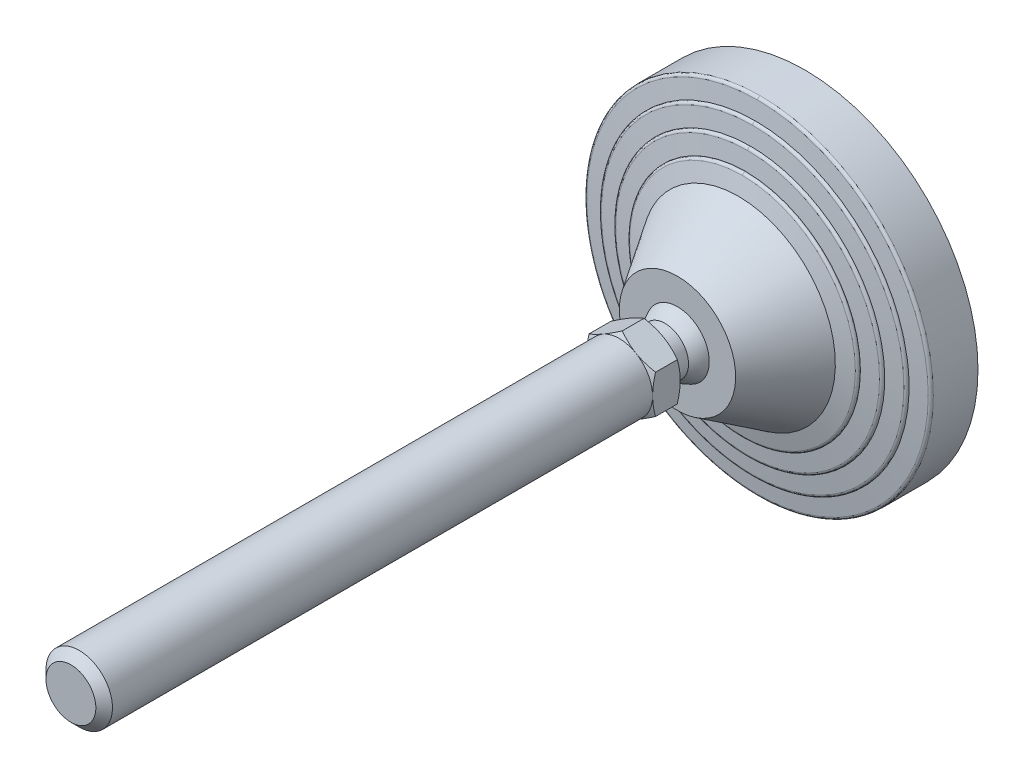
ISO-10303-21;
HEADER;
FILE_DESCRIPTION(('STEP AP214'),'2;1');
FILE_NAME('part.step','',(''),(''),'','','');
FILE_SCHEMA(('AUTOMOTIVE_DESIGN { 1 0 10303 214 1 1 1 1 }'));
ENDSEC;
DATA;
#1=APPLICATION_CONTEXT('core data for automotive mechanical design processes');
#2=APPLICATION_PROTOCOL_DEFINITION('international standard','automotive_design',2000,#1);
#3=PRODUCT_CONTEXT('',#1,'mechanical');
#4=PRODUCT('Part','Part','',(#3));
#5=PRODUCT_RELATED_PRODUCT_CATEGORY('part','',(#4));
#6=PRODUCT_DEFINITION_FORMATION('','',#4);
#7=PRODUCT_DEFINITION_CONTEXT('part definition',#1,'design');
#8=PRODUCT_DEFINITION('design','',#6,#7);
#9=PRODUCT_DEFINITION_SHAPE('','',#8);
#10=(LENGTH_UNIT() NAMED_UNIT(*) SI_UNIT(.MILLI.,.METRE.));
#11=(NAMED_UNIT(*) PLANE_ANGLE_UNIT() SI_UNIT($,.RADIAN.));
#12=(NAMED_UNIT(*) SI_UNIT($,.STERADIAN.) SOLID_ANGLE_UNIT());
#13=UNCERTAINTY_MEASURE_WITH_UNIT(LENGTH_MEASURE(1.E-05),#10,'distance_accuracy_value','');
#14=(GEOMETRIC_REPRESENTATION_CONTEXT(3) GLOBAL_UNCERTAINTY_ASSIGNED_CONTEXT((#13)) GLOBAL_UNIT_ASSIGNED_CONTEXT((#10,
#11,#12)) REPRESENTATION_CONTEXT('',''));
#15=CARTESIAN_POINT('',(0.,0.,0.));
#16=DIRECTION('',(0.,0.,1.));
#17=DIRECTION('',(1.,0.,0.));
#18=AXIS2_PLACEMENT_3D('',#15,#16,#17);
#19=CARTESIAN_POINT('',(-63.467641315,63.25,0.));
#20=DIRECTION('',(0.,0.,1.));
#21=DIRECTION('',(0.,-1.,0.));
#22=AXIS2_PLACEMENT_3D('',#19,#20,#21);
#23=PLANE('',#22);
#24=CARTESIAN_POINT('',(0.,0.,0.));
#25=DIRECTION('',(0.,0.,-1.));
#26=DIRECTION('',(0.,1.,0.));
#27=AXIS2_PLACEMENT_3D('',#24,#25,#26);
#28=CIRCLE('',#27,62.5);
#29=CARTESIAN_POINT('',(0.,62.5,0.));
#30=VERTEX_POINT('',#29);
#31=EDGE_CURVE('E419',#30,#30,#28,.F.);
#32=ORIENTED_EDGE('',*,*,#31,.F.);
#33=EDGE_LOOP('',(#32));
#34=FACE_BOUND('',#33,.T.);
#35=ADVANCED_FACE('F14',(#34),#23,.F.);
#36=CARTESIAN_POINT('',(0.,0.,16.119206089));
#37=DIRECTION('',(0.,0.,-1.));
#38=DIRECTION('',(0.,1.,0.));
#39=AXIS2_PLACEMENT_3D('',#36,#37,#38);
#40=CYLINDRICAL_SURFACE('',#39,62.5);
#41=ORIENTED_EDGE('',*,*,#31,.T.);
#42=EDGE_LOOP('',(#41));
#43=FACE_BOUND('',#42,.T.);
#44=CARTESIAN_POINT('',(0.,0.,16.119206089));
#45=DIRECTION('',(0.,0.,1.));
#46=DIRECTION('',(0.,-1.,0.));
#47=AXIS2_PLACEMENT_3D('',#44,#45,#46);
#48=CIRCLE('',#47,62.5);
#49=CARTESIAN_POINT('',(-6.4094821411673E-09,-62.5,16.119206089));
#50=VERTEX_POINT('',#49);
#51=CARTESIAN_POINT('',(0.,62.5,16.119206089));
#52=VERTEX_POINT('',#51);
#53=EDGE_CURVE('E572',#50,#52,#48,.T.);
#54=ORIENTED_EDGE('',*,*,#53,.F.);
#55=CARTESIAN_POINT('',(0.,0.,16.119206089));
#56=DIRECTION('',(0.,0.,1.));
#57=DIRECTION('',(0.,-1.,0.));
#58=AXIS2_PLACEMENT_3D('',#55,#56,#57);
#59=CIRCLE('',#58,62.5);
#60=EDGE_CURVE('E422',#52,#50,#59,.T.);
#61=ORIENTED_EDGE('',*,*,#60,.F.);
#62=EDGE_LOOP('',(#54,#61));
#63=FACE_BOUND('',#62,.T.);
#64=ADVANCED_FACE('F285',(#43,#63),#40,.T.);
#65=CARTESIAN_POINT('',(0.,-62.5,16.119206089));
#66=CARTESIAN_POINT('',(-125.,-62.5,16.119206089));
#67=CARTESIAN_POINT('',(-125.,62.5,16.119206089));
#68=CARTESIAN_POINT('',(0.,62.5,16.119206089));
#69=CARTESIAN_POINT('',(0.,-62.5,16.647800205));
#70=CARTESIAN_POINT('',(-125.,-62.5,16.647800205));
#71=CARTESIAN_POINT('',(-125.,62.5,16.647800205));
#72=CARTESIAN_POINT('',(0.,62.5,16.647800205));
#73=CARTESIAN_POINT('',(0.,-62.150618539,17.044466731));
#74=CARTESIAN_POINT('',(-124.301237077,-62.1506185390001,17.044466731));
#75=CARTESIAN_POINT('',(-124.301237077,62.1506185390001,17.044466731));
#76=CARTESIAN_POINT('',(0.,62.150618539,17.044466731));
#77=CARTESIAN_POINT('',(0.,-61.62625428,17.111204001));
#78=CARTESIAN_POINT('',(-123.252508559,-61.6262542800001,17.111204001));
#79=CARTESIAN_POINT('',(-123.252508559,61.6262542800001,17.111204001));
#80=CARTESIAN_POINT('',(0.,61.62625428,17.111204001));
#81=(BOUNDED_SURFACE() B_SPLINE_SURFACE(3,3,((#65,#66,#67,#68),(#69,#70,#71,#72),(#73,#74,#75,
#76),(#77,#78,#79,#80)),.UNSPECIFIED.,.F.,.F.,.F.) B_SPLINE_SURFACE_WITH_KNOTS((4,4),(4,4),(0.,
1.),(0.,1.),.UNSPECIFIED.) GEOMETRIC_REPRESENTATION_ITEM() RATIONAL_B_SPLINE_SURFACE(((1.,
0.333333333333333,0.333333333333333,1.),(0.833611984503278,0.277870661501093,0.277870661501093,
0.833611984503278),(0.833611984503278,0.277870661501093,0.277870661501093,0.833611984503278),
(1.,0.333333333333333,0.333333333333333,1.))) REPRESENTATION_ITEM('') SURFACE());
#82=CARTESIAN_POINT('',(0.,62.5,16.119206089));
#83=CARTESIAN_POINT('',(0.,62.5,16.647800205));
#84=CARTESIAN_POINT('',(0.,62.150618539,17.044466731));
#85=CARTESIAN_POINT('',(0.,61.62625428,17.111204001));
#86=(BOUNDED_CURVE() B_SPLINE_CURVE(3,(#82,#83,#84,#85),.UNSPECIFIED.,.F.,
.F.) B_SPLINE_CURVE_WITH_KNOTS((4,4),(0.,1.),
.UNSPECIFIED.) CURVE() GEOMETRIC_REPRESENTATION_ITEM() RATIONAL_B_SPLINE_CURVE((1.,
0.833611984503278,0.833611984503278,1.)) REPRESENTATION_ITEM(''));
#87=CARTESIAN_POINT('',(0.,61.6262542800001,17.111204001));
#88=VERTEX_POINT('',#87);
#89=EDGE_CURVE('E563',#52,#88,#86,.T.);
#90=CARTESIAN_POINT('',(0.,-62.5,16.119206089));
#91=CARTESIAN_POINT('',(0.,-62.5,16.647800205));
#92=CARTESIAN_POINT('',(0.,-62.150618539,17.044466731));
#93=CARTESIAN_POINT('',(0.,-61.62625428,17.111204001));
#94=(BOUNDED_CURVE() B_SPLINE_CURVE(3,(#90,#91,#92,#93),.UNSPECIFIED.,.F.,
.F.) B_SPLINE_CURVE_WITH_KNOTS((4,4),(0.,1.),
.UNSPECIFIED.) CURVE() GEOMETRIC_REPRESENTATION_ITEM() RATIONAL_B_SPLINE_CURVE((1.,
0.833611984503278,0.833611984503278,1.)) REPRESENTATION_ITEM(''));
#95=CARTESIAN_POINT('',(-1.89596340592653E-08,-61.6262542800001,17.111204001));
#96=VERTEX_POINT('',#95);
#97=EDGE_CURVE('E577',#96,#50,#94,.F.);
#98=CARTESIAN_POINT('',(0.,0.,17.111204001));
#99=DIRECTION('',(0.,0.,-1.));
#100=DIRECTION('',(0.,1.,0.));
#101=AXIS2_PLACEMENT_3D('',#98,#99,#100);
#102=CIRCLE('',#101,61.62625428);
#103=EDGE_CURVE('E556',#88,#96,#102,.F.);
#104=ORIENTED_EDGE('',*,*,#89,.F.);
#105=ORIENTED_EDGE('',*,*,#60,.T.);
#106=ORIENTED_EDGE('',*,*,#97,.F.);
#107=ORIENTED_EDGE('',*,*,#103,.F.);
#108=EDGE_LOOP('',(#104,#105,#106,#107));
#109=FACE_BOUND('',#108,.T.);
#110=ADVANCED_FACE('F923',(#109),#81,.T.);
#111=CARTESIAN_POINT('',(0.,62.5,16.119206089));
#112=CARTESIAN_POINT('',(125.,62.5,16.119206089));
#113=CARTESIAN_POINT('',(125.,-62.5,16.119206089));
#114=CARTESIAN_POINT('',(0.,-62.5,16.119206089));
#115=CARTESIAN_POINT('',(0.,62.5,16.647800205));
#116=CARTESIAN_POINT('',(125.,62.5,16.647800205));
#117=CARTESIAN_POINT('',(125.,-62.5,16.647800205));
#118=CARTESIAN_POINT('',(0.,-62.5,16.647800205));
#119=CARTESIAN_POINT('',(0.,62.150618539,17.044466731));
#120=CARTESIAN_POINT('',(124.301237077,62.1506185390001,17.044466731));
#121=CARTESIAN_POINT('',(124.301237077,-62.1506185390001,17.044466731));
#122=CARTESIAN_POINT('',(0.,-62.150618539,17.044466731));
#123=CARTESIAN_POINT('',(0.,61.62625428,17.111204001));
#124=CARTESIAN_POINT('',(123.252508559,61.6262542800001,17.111204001));
#125=CARTESIAN_POINT('',(123.252508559,-61.6262542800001,17.111204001));
#126=CARTESIAN_POINT('',(0.,-61.62625428,17.111204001));
#127=(BOUNDED_SURFACE() B_SPLINE_SURFACE(3,3,((#111,#112,#113,#114),(#115,#116,#117,#118),(#119,
#120,#121,#122),(#123,#124,#125,#126)),.UNSPECIFIED.,.F.,.F.,
.F.) B_SPLINE_SURFACE_WITH_KNOTS((4,4),(4,4),(0.,1.),(0.,1.),
.UNSPECIFIED.) GEOMETRIC_REPRESENTATION_ITEM() RATIONAL_B_SPLINE_SURFACE(((1.,0.333333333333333,
0.333333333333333,1.),(0.833611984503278,0.277870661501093,0.277870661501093,0.833611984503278),
(0.833611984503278,0.277870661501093,0.277870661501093,0.833611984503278),(1.,0.333333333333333,
0.333333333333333,1.))) REPRESENTATION_ITEM('') SURFACE());
#128=CARTESIAN_POINT('',(0.,0.,17.111204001));
#129=DIRECTION('',(0.,0.,-1.));
#130=DIRECTION('',(0.,1.,0.));
#131=AXIS2_PLACEMENT_3D('',#128,#129,#130);
#132=CIRCLE('',#131,61.62625428);
#133=EDGE_CURVE('E562',#96,#88,#132,.F.);
#134=ORIENTED_EDGE('',*,*,#53,.T.);
#135=ORIENTED_EDGE('',*,*,#89,.T.);
#136=ORIENTED_EDGE('',*,*,#133,.F.);
#137=ORIENTED_EDGE('',*,*,#97,.T.);
#138=EDGE_LOOP('',(#134,#135,#136,#137));
#139=FACE_BOUND('',#138,.T.);
#140=ADVANCED_FACE('F404',(#139),#127,.T.);
#141=CARTESIAN_POINT('',(0.,0.,17.890909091));
#142=DIRECTION('',(0.,0.,-1.));
#143=DIRECTION('',(0.,1.,0.));
#144=AXIS2_PLACEMENT_3D('',#141,#142,#143);
#145=CONICAL_SURFACE('',#144,55.5,1.44420419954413);
#146=ORIENTED_EDGE('',*,*,#103,.T.);
#147=ORIENTED_EDGE('',*,*,#133,.T.);
#148=EDGE_LOOP('',(#146,#147));
#149=FACE_BOUND('',#148,.T.);
#150=CARTESIAN_POINT('',(-1.13830957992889E-08,-55.5,17.890909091));
#151=CARTESIAN_POINT('',(0.666810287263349,-55.5000058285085,17.890909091));
#152=CARTESIAN_POINT('',(1.33362158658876,-55.4879831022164,17.890909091));
#153=CARTESIAN_POINT('',(2.6682821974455,-55.4398527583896,17.890909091));
#154=CARTESIAN_POINT('',(3.33612903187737,-55.4036764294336,17.890909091));
#155=CARTESIAN_POINT('',(4.67008368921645,-55.3072108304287,17.890909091));
#156=CARTESIAN_POINT('',(5.33619149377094,-55.2469213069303,17.890909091));
#157=CARTESIAN_POINT('',(6.66630694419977,-55.1022519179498,17.890909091));
#158=CARTESIAN_POINT('',(7.33031261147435,-55.0178537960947,17.890909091));
#159=CARTESIAN_POINT('',(8.65488946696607,-54.8250946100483,17.890909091));
#160=CARTESIAN_POINT('',(9.31546019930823,-54.7167304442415,17.890909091));
#161=CARTESIAN_POINT('',(11.3032442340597,-54.3535835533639,17.890909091));
#162=CARTESIAN_POINT('',(12.6239565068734,-54.0621103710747,17.890909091));
#163=CARTESIAN_POINT('',(15.2407929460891,-53.3834839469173,17.890909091));
#164=CARTESIAN_POINT('',(16.5369104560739,-52.9963051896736,17.890909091));
#165=CARTESIAN_POINT('',(19.0989356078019,-52.1278427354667,17.890909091));
#166=CARTESIAN_POINT('',(20.3648068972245,-51.6464516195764,17.890909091));
#167=CARTESIAN_POINT('',(22.8579438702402,-50.592453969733,17.890909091));
#168=CARTESIAN_POINT('',(24.0852091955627,-50.0198465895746,17.890909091));
#169=CARTESIAN_POINT('',(26.67866762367,-48.6922162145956,17.890909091));
#170=CARTESIAN_POINT('',(28.0374663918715,-47.9226902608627,17.890909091));
#171=CARTESIAN_POINT('',(30.6855194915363,-46.2718474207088,17.890909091));
#172=CARTESIAN_POINT('',(31.9747656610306,-45.3905174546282,17.890909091));
#173=CARTESIAN_POINT('',(34.4745529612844,-43.5222940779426,17.890909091));
#174=CARTESIAN_POINT('',(35.6850872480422,-42.5353915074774,17.890909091));
#175=CARTESIAN_POINT('',(38.0186685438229,-40.4631409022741,17.890909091));
#176=CARTESIAN_POINT('',(39.1417181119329,-39.3777957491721,17.890909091));
#177=CARTESIAN_POINT('',(41.2923479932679,-37.1163936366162,17.890909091));
#178=CARTESIAN_POINT('',(42.3199319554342,-35.9403401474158,17.890909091));
#179=CARTESIAN_POINT('',(44.2723789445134,-33.5058382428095,17.890909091));
#180=CARTESIAN_POINT('',(45.1972412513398,-32.2473892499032,17.890909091));
#181=CARTESIAN_POINT('',(46.9376312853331,-29.6570957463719,17.890909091));
#182=CARTESIAN_POINT('',(47.7531628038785,-28.3252537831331,17.890909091));
#183=CARTESIAN_POINT('',(49.2691299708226,-25.5976050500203,17.890909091));
#184=CARTESIAN_POINT('',(49.9695658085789,-24.201798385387,17.890909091));
#185=CARTESIAN_POINT('',(51.2503706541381,-21.356125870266,17.890909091));
#186=CARTESIAN_POINT('',(51.8307383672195,-19.9062594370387,17.890909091));
#187=CARTESIAN_POINT('',(52.8672716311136,-16.962788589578,17.890909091));
#188=CARTESIAN_POINT('',(53.3234371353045,-15.4691841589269,17.890909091));
#189=CARTESIAN_POINT('',(54.1083272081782,-12.4488388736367,17.890909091));
#190=CARTESIAN_POINT('',(54.4370503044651,-10.9220976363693,17.890909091));
#191=CARTESIAN_POINT('',(54.964711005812,-7.8463498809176,17.890909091));
#192=CARTESIAN_POINT('',(55.1636486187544,-6.2973433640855,17.890909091));
#193=CARTESIAN_POINT('',(55.4303245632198,-3.18807153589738,17.890909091));
#194=CARTESIAN_POINT('',(55.4980623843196,-1.62780618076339,17.890909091));
#195=CARTESIAN_POINT('',(55.5018556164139,1.49288460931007,17.890909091));
#196=CARTESIAN_POINT('',(55.4379110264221,3.05331004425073,17.890909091));
#197=CARTESIAN_POINT('',(55.1787965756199,6.16319684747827,17.890909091));
#198=CARTESIAN_POINT('',(54.9836292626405,7.71265842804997,17.890909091));
#199=CARTESIAN_POINT('',(54.4634594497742,10.7896325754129,17.890909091));
#200=CARTESIAN_POINT('',(54.1384569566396,12.3171451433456,17.890909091));
#201=CARTESIAN_POINT('',(53.3609336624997,15.3393372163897,17.890909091));
#202=CARTESIAN_POINT('',(52.9084149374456,16.8340172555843,17.890909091));
#203=CARTESIAN_POINT('',(51.8790738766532,19.7799443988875,17.890909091));
#204=CARTESIAN_POINT('',(51.3022515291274,21.2311914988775,17.890909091));
#205=CARTESIAN_POINT('',(50.0283709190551,24.0800097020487,17.890909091));
#206=CARTESIAN_POINT('',(49.3313064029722,25.477578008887,17.890909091));
#207=CARTESIAN_POINT('',(47.8219174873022,28.2090226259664,17.890909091));
#208=CARTESIAN_POINT('',(47.0095931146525,29.5428989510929,17.890909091));
#209=CARTESIAN_POINT('',(45.2754391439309,32.1375097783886,17.890909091));
#210=CARTESIAN_POINT('',(44.3536065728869,33.398242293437,17.890909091));
#211=CARTESIAN_POINT('',(42.4069961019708,35.8375708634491,17.890909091));
#212=CARTESIAN_POINT('',(41.3822180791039,37.0161668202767,17.890909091));
#213=CARTESIAN_POINT('',(39.237157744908,39.2826945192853,17.890909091));
#214=CARTESIAN_POINT('',(38.1168855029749,40.3706357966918,17.890909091));
#215=CARTESIAN_POINT('',(35.7885615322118,42.448352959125,17.890909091));
#216=CARTESIAN_POINT('',(34.5805102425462,43.4381293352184,17.890909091));
#217=CARTESIAN_POINT('',(32.5014047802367,44.9999063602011,17.890909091));
#218=CARTESIAN_POINT('',(31.6521856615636,45.6012216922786,17.890909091));
#219=CARTESIAN_POINT('',(29.9212415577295,46.7552239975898,17.890909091));
#220=CARTESIAN_POINT('',(29.0395163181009,47.3079105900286,17.890909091));
#221=CARTESIAN_POINT('',(27.2463975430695,48.362857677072,17.890909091));
#222=CARTESIAN_POINT('',(26.3350034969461,48.8651173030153,17.890909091));
#223=CARTESIAN_POINT('',(24.4853750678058,49.8176528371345,17.890909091));
#224=CARTESIAN_POINT('',(23.5471392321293,50.2679259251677,17.890909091));
#225=CARTESIAN_POINT('',(21.646864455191,51.1150215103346,17.890909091));
#226=CARTESIAN_POINT('',(20.6848259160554,51.5118449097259,17.890909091));
#227=CARTESIAN_POINT('',(18.7400290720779,52.2507726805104,17.890909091));
#228=CARTESIAN_POINT('',(17.7572723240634,52.5928811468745,17.890909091));
#229=CARTESIAN_POINT('',(15.8636176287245,53.1929617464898,17.890909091));
#230=CARTESIAN_POINT('',(14.9542390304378,53.4557406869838,17.890909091));
#231=CARTESIAN_POINT('',(13.1232854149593,53.9344479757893,17.890909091));
#232=CARTESIAN_POINT('',(12.2017111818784,54.1503793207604,17.890909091));
#233=CARTESIAN_POINT('',(10.3487557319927,54.5348378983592,17.890909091));
#234=CARTESIAN_POINT('',(9.41737477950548,54.7033664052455,17.890909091));
#235=CARTESIAN_POINT('',(7.54728204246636,54.9925789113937,17.890909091));
#236=CARTESIAN_POINT('',(6.60857079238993,55.1132663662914,17.890909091));
#237=CARTESIAN_POINT('',(4.72616569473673,55.3064952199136,17.890909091));
#238=CARTESIAN_POINT('',(3.78247163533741,55.379034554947,17.890909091));
#239=CARTESIAN_POINT('',(1.89251924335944,55.4758006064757,17.890909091));
#240=CARTESIAN_POINT('',(0.946260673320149,55.5000226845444,17.890909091));
#241=CARTESIAN_POINT('',(-1.66116711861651E-09,55.5,17.890909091));
#242=B_SPLINE_CURVE_WITH_KNOTS('',3,(#150,#151,#152,#153,#154,#155,#156,#157,#158,#159,#160,
#161,#162,#163,#164,#165,#166,#167,#168,#169,#170,#171,#172,#173,#174,#175,#176,#177,#178,#179,
#180,#181,#182,#183,#184,#185,#186,#187,#188,#189,#190,#191,#192,#193,#194,#195,#196,#197,#198,
#199,#200,#201,#202,#203,#204,#205,#206,#207,#208,#209,#210,#211,#212,#213,#214,#215,#216,#217,
#218,#219,#220,#221,#222,#223,#224,#225,#226,#227,#228,#229,#230,#231,#232,#233,#234,#235,#236,
#237,#238,#239,#240,#241),.UNSPECIFIED.,.F.,.F.,(4,2,2,2,2,2,2,2,2,2,2,2,2,2,2,2,2,2,2,2,2,2,2,
2,2,2,2,2,2,2,2,2,2,2,2,2,2,2,2,2,2,2,2,2,2,4),(0.,2.00032482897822,4.00636450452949,
6.0124252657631,8.02000917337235,10.0278530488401,14.0813911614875,18.1360111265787,
22.1952813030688,26.2545891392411,30.9336173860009,35.6131935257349,40.2931760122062,
44.9730215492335,49.6526881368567,54.3323875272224,59.0119245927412,63.6914539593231,
68.3710337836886,73.0506153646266,77.7302510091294,82.4098863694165,87.0895399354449,
91.7691935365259,96.4487562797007,101.128318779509,105.807805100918,110.487291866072,
115.167022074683,119.846751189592,124.52660738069,129.20646916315,133.885838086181,
138.565183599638,141.685351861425,144.805544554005,147.925790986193,151.046206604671,
154.166569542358,157.286698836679,160.125236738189,162.963593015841,165.801872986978,
168.639947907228,171.478144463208,174.316613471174),.UNSPECIFIED.);
#243=CARTESIAN_POINT('',(-1.13832320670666E-08,-55.5,17.895966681));
#244=VERTEX_POINT('',#243);
#245=CARTESIAN_POINT('',(-1.6611821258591E-09,55.5,17.895966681));
#246=VERTEX_POINT('',#245);
#247=EDGE_CURVE('E385',#244,#246,#242,.T.);
#248=ORIENTED_EDGE('',*,*,#247,.F.);
#249=CARTESIAN_POINT('',(-1.66117986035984E-09,55.5,17.890909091));
#250=CARTESIAN_POINT('',(-0.666810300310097,55.5000058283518,17.890909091));
#251=CARTESIAN_POINT('',(-1.33362159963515,55.4879831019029,17.890909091));
#252=CARTESIAN_POINT('',(-2.66828221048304,55.4398527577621,17.890909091));
#253=CARTESIAN_POINT('',(-3.33612904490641,55.403676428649,17.890909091));
#254=CARTESIAN_POINT('',(-4.6700837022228,55.3072108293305,17.890909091));
#255=CARTESIAN_POINT('',(-5.33619150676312,55.2469213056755,17.890909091));
#256=CARTESIAN_POINT('',(-6.66630695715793,55.1022519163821,17.890909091));
#257=CARTESIAN_POINT('',(-7.33031262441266,55.0178537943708,17.890909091));
#258=CARTESIAN_POINT('',(-8.65488947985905,54.8250946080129,17.890909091));
#259=CARTESIAN_POINT('',(-9.31546021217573,54.7167304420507,17.890909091));
#260=CARTESIAN_POINT('',(-11.3032442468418,54.3535835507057,17.890909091));
#261=CARTESIAN_POINT('',(-12.6239565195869,54.0621103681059,17.890909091));
#262=CARTESIAN_POINT('',(-15.2407929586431,53.3834839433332,17.890909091));
#263=CARTESIAN_POINT('',(-16.5369104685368,52.9963051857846,17.890909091));
#264=CARTESIAN_POINT('',(-19.0989356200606,52.1278427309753,17.890909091));
#265=CARTESIAN_POINT('',(-20.36480690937,51.6464516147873,17.890909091));
#266=CARTESIAN_POINT('',(-22.8579438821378,50.5924539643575,17.890909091));
#267=CARTESIAN_POINT('',(-24.0852092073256,50.0198465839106,17.890909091));
#268=CARTESIAN_POINT('',(-26.6786676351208,48.6922162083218,17.890909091));
#269=CARTESIAN_POINT('',(-28.0374664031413,47.9226902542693,17.890909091));
#270=CARTESIAN_POINT('',(-30.6855195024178,46.2718474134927,17.890909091));
#271=CARTESIAN_POINT('',(-31.9747656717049,45.3905174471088,17.890909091));
#272=CARTESIAN_POINT('',(-34.4745529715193,43.5222940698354,17.890909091));
#273=CARTESIAN_POINT('',(-35.6850872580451,42.5353914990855,17.890909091));
#274=CARTESIAN_POINT('',(-38.0186685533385,40.4631408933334,17.890909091));
#275=CARTESIAN_POINT('',(-39.1417181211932,39.3777957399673,17.890909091));
#276=CARTESIAN_POINT('',(-41.2923480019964,37.1163936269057,17.890909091));
#277=CARTESIAN_POINT('',(-42.3199319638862,35.9403401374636,17.890909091));
#278=CARTESIAN_POINT('',(-44.2723789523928,33.5058382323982,17.890909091));
#279=CARTESIAN_POINT('',(-45.1972412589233,32.2473892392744,17.890909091));
#280=CARTESIAN_POINT('',(-46.9376312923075,29.6570957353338,17.890909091));
#281=CARTESIAN_POINT('',(-47.7531628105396,28.3252537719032,17.890909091));
#282=CARTESIAN_POINT('',(-49.2691299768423,25.5976050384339,17.890909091));
#283=CARTESIAN_POINT('',(-49.9695658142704,24.2017983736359,17.890909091));
#284=CARTESIAN_POINT('',(-51.2503706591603,21.3561258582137,17.890909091));
#285=CARTESIAN_POINT('',(-51.8307383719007,19.9062594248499,17.890909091));
#286=CARTESIAN_POINT('',(-52.8672716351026,16.9627885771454,17.890909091));
#287=CARTESIAN_POINT('',(-53.3234371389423,15.469184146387,17.890909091));
#288=CARTESIAN_POINT('',(-54.1083272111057,12.4488388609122,17.890909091));
#289=CARTESIAN_POINT('',(-54.4370503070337,10.9220976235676,17.890909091));
#290=CARTESIAN_POINT('',(-54.9647110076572,7.84634986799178,17.890909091));
#291=CARTESIAN_POINT('',(-55.1636486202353,6.2973433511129,17.890909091));
#292=CARTESIAN_POINT('',(-55.4303245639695,3.1880715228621,17.890909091));
#293=CARTESIAN_POINT('',(-55.4980623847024,1.6278061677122,17.890909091));
#294=CARTESIAN_POINT('',(-55.5018556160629,-1.49288462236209,17.890909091));
#295=CARTESIAN_POINT('',(-55.437911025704,-3.05331005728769,17.890909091));
#296=CARTESIAN_POINT('',(-55.1787965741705,-6.1631968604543,17.890909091));
#297=CARTESIAN_POINT('',(-54.9836292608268,-7.71265844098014,17.890909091));
#298=CARTESIAN_POINT('',(-54.4634594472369,-10.7896325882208,17.890909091));
#299=CARTESIAN_POINT('',(-54.138456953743,-12.3171451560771,17.890909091));
#300=CARTESIAN_POINT('',(-53.3609336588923,-15.3393372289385,17.890909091));
#301=CARTESIAN_POINT('',(-52.9084149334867,-16.8340172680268,17.890909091));
#302=CARTESIAN_POINT('',(-51.8790738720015,-19.7799444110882,17.890909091));
#303=CARTESIAN_POINT('',(-51.3022515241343,-21.2311915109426,17.890909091));
#304=CARTESIAN_POINT('',(-50.0283709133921,-24.0800097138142,17.890909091));
#305=CARTESIAN_POINT('',(-49.3313063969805,-25.4775780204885,17.890909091));
#306=CARTESIAN_POINT('',(-47.8219174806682,-28.2090226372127,17.890909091));
#307=CARTESIAN_POINT('',(-47.009593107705,-29.542898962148,17.890909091));
#308=CARTESIAN_POINT('',(-45.2754391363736,-32.1375097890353,17.890909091));
#309=CARTESIAN_POINT('',(-44.3536065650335,-33.3982423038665,17.890909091));
#310=CARTESIAN_POINT('',(-42.4069960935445,-35.83757087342,17.890909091));
#311=CARTESIAN_POINT('',(-41.3822180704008,-37.0161668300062,17.890909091));
#312=CARTESIAN_POINT('',(-39.237157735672,-39.2826945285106,17.890909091));
#313=CARTESIAN_POINT('',(-38.1168854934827,-40.3706358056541,17.890909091));
#314=CARTESIAN_POINT('',(-35.7885615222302,-42.4483529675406,17.890909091));
#315=CARTESIAN_POINT('',(-34.5805102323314,-43.4381293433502,17.890909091));
#316=CARTESIAN_POINT('',(-32.5014047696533,-44.9999063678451,17.890909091));
#317=CARTESIAN_POINT('',(-31.6521856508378,-45.6012216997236,17.890909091));
#318=CARTESIAN_POINT('',(-29.92124154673,-46.755224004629,17.890909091));
#319=CARTESIAN_POINT('',(-29.0395163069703,-47.307910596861,17.890909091));
#320=CARTESIAN_POINT('',(-27.2463975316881,-48.3628576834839,17.890909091));
#321=CARTESIAN_POINT('',(-26.3350034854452,-48.8651173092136,17.890909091));
#322=CARTESIAN_POINT('',(-24.4853750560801,-49.8176528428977,17.890909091));
#323=CARTESIAN_POINT('',(-23.5471392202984,-50.2679259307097,17.890909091));
#324=CARTESIAN_POINT('',(-21.6468644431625,-51.1150215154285,17.890909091));
#325=CARTESIAN_POINT('',(-20.6848259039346,-51.511844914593,17.890909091));
#326=CARTESIAN_POINT('',(-18.7400290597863,-52.2507726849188,17.890909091));
#327=CARTESIAN_POINT('',(-17.7572723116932,-52.5928811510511,17.890909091));
#328=CARTESIAN_POINT('',(-15.8636176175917,-53.1929617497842,17.890909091));
#329=CARTESIAN_POINT('',(-14.9542390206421,-53.4557406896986,17.890909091));
#330=CARTESIAN_POINT('',(-13.1232854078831,-53.9344479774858,17.890909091));
#331=CARTESIAN_POINT('',(-12.2017111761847,-54.1503793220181,17.890909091));
#332=CARTESIAN_POINT('',(-10.3487557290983,-54.5348378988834,17.890909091));
#333=CARTESIAN_POINT('',(-9.41737477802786,-54.7033664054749,17.890909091));
#334=CARTESIAN_POINT('',(-7.54728204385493,-54.9925789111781,17.890909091));
#335=CARTESIAN_POINT('',(-6.60857079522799,-55.1132663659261,17.890909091));
#336=CARTESIAN_POINT('',(-4.72616570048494,-55.3064952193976,17.890909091));
#337=CARTESIAN_POINT('',(-3.78247164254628,-55.3790345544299,17.890909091));
#338=CARTESIAN_POINT('',(-1.89251925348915,-55.4758006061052,17.890909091));
#339=CARTESIAN_POINT('',(-0.946260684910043,-55.5000226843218,17.890909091));
#340=CARTESIAN_POINT('',(-1.13832284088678E-08,-55.5,17.890909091));
#341=B_SPLINE_CURVE_WITH_KNOTS('',3,(#249,#250,#251,#252,#253,#254,#255,#256,#257,#258,#259,
#260,#261,#262,#263,#264,#265,#266,#267,#268,#269,#270,#271,#272,#273,#274,#275,#276,#277,#278,
#279,#280,#281,#282,#283,#284,#285,#286,#287,#288,#289,#290,#291,#292,#293,#294,#295,#296,#297,
#298,#299,#300,#301,#302,#303,#304,#305,#306,#307,#308,#309,#310,#311,#312,#313,#314,#315,#316,
#317,#318,#319,#320,#321,#322,#323,#324,#325,#326,#327,#328,#329,#330,#331,#332,#333,#334,#335,
#336,#337,#338,#339,#340),.UNSPECIFIED.,.F.,.F.,(4,2,2,2,2,2,2,2,2,2,2,2,2,2,2,2,2,2,2,2,2,2,2,
2,2,2,2,2,2,2,2,2,2,2,2,2,2,2,2,2,2,2,2,2,2,4),(0.,2.00032482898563,4.0063645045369,
6.01242526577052,8.02000917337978,10.0278530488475,14.0813911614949,18.1360111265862,
22.1952813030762,26.2545891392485,30.9336173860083,35.6131935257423,40.2931760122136,
44.9730215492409,49.6526881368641,54.3323875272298,59.0119245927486,63.6914539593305,
68.371033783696,73.050615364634,77.7302510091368,82.4098863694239,87.0895399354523,
91.7691935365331,96.4487562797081,101.128318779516,105.807805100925,110.48729186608,
115.167022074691,119.846751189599,124.526607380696,129.206469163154,133.885838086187,
138.565183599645,141.685351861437,144.80554455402,147.925790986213,151.046206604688,
154.166569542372,157.286698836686,160.125236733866,162.963593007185,165.801872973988,
168.639947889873,171.47814444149,174.316613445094),.UNSPECIFIED.);
#342=EDGE_CURVE('E397',#246,#244,#341,.T.);
#343=ORIENTED_EDGE('',*,*,#342,.F.);
#344=EDGE_LOOP('',(#248,#343));
#345=FACE_BOUND('',#344,.T.);
#346=ADVANCED_FACE('F399',(#149,#345),#145,.T.);
#347=CARTESIAN_POINT('',(0.,-55.5,17.887804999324));
#348=CARTESIAN_POINT('',(-111.,-55.5000000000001,17.8878049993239));
#349=CARTESIAN_POINT('',(-111.,55.5000000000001,17.8878049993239));
#350=CARTESIAN_POINT('',(0.,55.5,17.887804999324));
#351=CARTESIAN_POINT('',(0.,-55.5,17.892211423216));
#352=CARTESIAN_POINT('',(-111.,-55.5000000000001,17.892211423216));
#353=CARTESIAN_POINT('',(-111.,55.5000000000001,17.892211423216));
#354=CARTESIAN_POINT('',(0.,55.5,17.892211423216));
#355=CARTESIAN_POINT('',(0.,-55.5,17.896617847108));
#356=CARTESIAN_POINT('',(-111.,-55.5000000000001,17.896617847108));
#357=CARTESIAN_POINT('',(-111.,55.5000000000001,17.896617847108));
#358=CARTESIAN_POINT('',(0.,55.5,17.896617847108));
#359=CARTESIAN_POINT('',(0.,-55.5,17.901024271));
#360=CARTESIAN_POINT('',(-111.,-55.5000000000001,17.901024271));
#361=CARTESIAN_POINT('',(-111.,55.5000000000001,17.901024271));
#362=CARTESIAN_POINT('',(0.,55.5,17.901024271));
#363=CARTESIAN_POINT('',(0.,-55.5,18.429618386));
#364=CARTESIAN_POINT('',(-111.,-55.5,18.429618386));
#365=CARTESIAN_POINT('',(-111.,55.5,18.429618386));
#366=CARTESIAN_POINT('',(0.,55.5,18.429618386));
#367=CARTESIAN_POINT('',(0.,-55.150618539,18.826284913));
#368=CARTESIAN_POINT('',(-110.301237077,-55.150618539,18.826284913));
#369=CARTESIAN_POINT('',(-110.301237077,55.150618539,18.826284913));
#370=CARTESIAN_POINT('',(0.,55.150618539,18.826284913));
#371=CARTESIAN_POINT('',(0.,-54.62625428,18.893022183));
#372=CARTESIAN_POINT('',(-109.252508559,-54.62625428,18.893022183));
#373=CARTESIAN_POINT('',(-109.252508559,54.62625428,18.893022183));
#374=CARTESIAN_POINT('',(0.,54.62625428,18.893022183));
#375=(BOUNDED_SURFACE() B_SPLINE_SURFACE(3,3,((#347,#348,#349,#350),(#351,#352,#353,#354),(#355,
#356,#357,#358),(#359,#360,#361,#362),(#363,#364,#365,#366),(#367,#368,#369,#370),(#371,#372,
#373,#374)),.UNSPECIFIED.,.F.,.F.,.F.) B_SPLINE_SURFACE_WITH_KNOTS((4,3,4),(4,4),(-0.01,0.,1.),
(0.,1.),.UNSPECIFIED.) GEOMETRIC_REPRESENTATION_ITEM() RATIONAL_B_SPLINE_SURFACE(((1.,
0.333333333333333,0.333333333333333,1.),(1.,0.333333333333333,0.333333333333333,1.),(1.,
0.333333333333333,0.333333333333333,1.),(1.,0.333333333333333,0.333333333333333,1.),
(0.83361198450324,0.27787066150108,0.27787066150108,0.83361198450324),(0.83361198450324,
0.27787066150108,0.27787066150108,0.83361198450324),(1.,0.333333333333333,0.333333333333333,1.))) REPRESENTATION_ITEM('') SURFACE());
#376=CARTESIAN_POINT('',(0.,55.5,17.901024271));
#377=CARTESIAN_POINT('',(0.,55.5,18.429618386));
#378=CARTESIAN_POINT('',(0.,55.150618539,18.826284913));
#379=CARTESIAN_POINT('',(0.,54.62625428,18.893022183));
#380=(BOUNDED_CURVE() B_SPLINE_CURVE(3,(#376,#377,#378,#379),.UNSPECIFIED.,.F.,
.F.) B_SPLINE_CURVE_WITH_KNOTS((4,4),(0.,1.),
.UNSPECIFIED.) CURVE() GEOMETRIC_REPRESENTATION_ITEM() RATIONAL_B_SPLINE_CURVE((1.,
0.83361198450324,0.83361198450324,1.)) REPRESENTATION_ITEM(''));
#381=CARTESIAN_POINT('',(0.,54.6262542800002,18.8930221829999));
#382=VERTEX_POINT('',#381);
#383=EDGE_CURVE('E388',#246,#382,#380,.T.);
#384=CARTESIAN_POINT('',(0.,-55.5,17.901024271));
#385=CARTESIAN_POINT('',(0.,-55.5,18.429618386));
#386=CARTESIAN_POINT('',(0.,-55.150618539,18.826284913));
#387=CARTESIAN_POINT('',(0.,-54.62625428,18.893022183));
#388=(BOUNDED_CURVE() B_SPLINE_CURVE(3,(#384,#385,#386,#387),.UNSPECIFIED.,.F.,
.F.) B_SPLINE_CURVE_WITH_KNOTS((4,4),(0.,1.),
.UNSPECIFIED.) CURVE() GEOMETRIC_REPRESENTATION_ITEM() RATIONAL_B_SPLINE_CURVE((1.,
0.83361198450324,0.83361198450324,1.)) REPRESENTATION_ITEM(''));
#389=CARTESIAN_POINT('',(-1.68060480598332E-08,-54.6262542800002,18.8930221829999));
#390=VERTEX_POINT('',#389);
#391=EDGE_CURVE('E389',#390,#244,#388,.F.);
#392=CARTESIAN_POINT('',(0.,0.,18.8930221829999));
#393=DIRECTION('',(0.,0.,-1.));
#394=DIRECTION('',(0.,1.,0.));
#395=AXIS2_PLACEMENT_3D('',#392,#393,#394);
#396=CIRCLE('',#395,54.62625428);
#397=EDGE_CURVE('E528',#382,#390,#396,.F.);
#398=ORIENTED_EDGE('',*,*,#383,.F.);
#399=ORIENTED_EDGE('',*,*,#342,.T.);
#400=ORIENTED_EDGE('',*,*,#391,.F.);
#401=ORIENTED_EDGE('',*,*,#397,.F.);
#402=EDGE_LOOP('',(#398,#399,#400,#401));
#403=FACE_BOUND('',#402,.T.);
#404=ADVANCED_FACE('F403',(#403),#375,.T.);
#405=CARTESIAN_POINT('',(0.,55.5,17.887804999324));
#406=CARTESIAN_POINT('',(111.,55.5000000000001,17.8878049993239));
#407=CARTESIAN_POINT('',(111.,-55.5000000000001,17.8878049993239));
#408=CARTESIAN_POINT('',(0.,-55.5,17.887804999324));
#409=CARTESIAN_POINT('',(0.,55.5,17.892211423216));
#410=CARTESIAN_POINT('',(111.,55.5000000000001,17.892211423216));
#411=CARTESIAN_POINT('',(111.,-55.5000000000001,17.892211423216));
#412=CARTESIAN_POINT('',(0.,-55.5,17.892211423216));
#413=CARTESIAN_POINT('',(0.,55.5,17.896617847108));
#414=CARTESIAN_POINT('',(111.,55.5000000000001,17.896617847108));
#415=CARTESIAN_POINT('',(111.,-55.5000000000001,17.896617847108));
#416=CARTESIAN_POINT('',(0.,-55.5,17.896617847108));
#417=CARTESIAN_POINT('',(0.,55.5,17.901024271));
#418=CARTESIAN_POINT('',(111.,55.5000000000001,17.901024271));
#419=CARTESIAN_POINT('',(111.,-55.5000000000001,17.901024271));
#420=CARTESIAN_POINT('',(0.,-55.5,17.901024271));
#421=CARTESIAN_POINT('',(0.,55.5,18.429618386));
#422=CARTESIAN_POINT('',(111.,55.5,18.429618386));
#423=CARTESIAN_POINT('',(111.,-55.5,18.429618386));
#424=CARTESIAN_POINT('',(0.,-55.5,18.429618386));
#425=CARTESIAN_POINT('',(0.,55.150618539,18.826284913));
#426=CARTESIAN_POINT('',(110.301237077,55.150618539,18.826284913));
#427=CARTESIAN_POINT('',(110.301237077,-55.150618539,18.826284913));
#428=CARTESIAN_POINT('',(0.,-55.150618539,18.826284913));
#429=CARTESIAN_POINT('',(0.,54.62625428,18.893022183));
#430=CARTESIAN_POINT('',(109.252508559,54.62625428,18.893022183));
#431=CARTESIAN_POINT('',(109.252508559,-54.62625428,18.893022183));
#432=CARTESIAN_POINT('',(0.,-54.62625428,18.893022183));
#433=(BOUNDED_SURFACE() B_SPLINE_SURFACE(3,3,((#405,#406,#407,#408),(#409,#410,#411,#412),(#413,
#414,#415,#416),(#417,#418,#419,#420),(#421,#422,#423,#424),(#425,#426,#427,#428),(#429,#430,
#431,#432)),.UNSPECIFIED.,.F.,.F.,.F.) B_SPLINE_SURFACE_WITH_KNOTS((4,3,4),(4,4),(-0.01,0.,1.),
(0.,1.),.UNSPECIFIED.) GEOMETRIC_REPRESENTATION_ITEM() RATIONAL_B_SPLINE_SURFACE(((1.,
0.333333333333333,0.333333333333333,1.),(1.,0.333333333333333,0.333333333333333,1.),(1.,
0.333333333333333,0.333333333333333,1.),(1.,0.333333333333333,0.333333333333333,1.),
(0.83361198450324,0.27787066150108,0.27787066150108,0.83361198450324),(0.83361198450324,
0.27787066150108,0.27787066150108,0.83361198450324),(1.,0.333333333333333,0.333333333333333,1.))) REPRESENTATION_ITEM('') SURFACE());
#434=CARTESIAN_POINT('',(0.,0.,18.8930221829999));
#435=DIRECTION('',(0.,0.,-1.));
#436=DIRECTION('',(0.,1.,0.));
#437=AXIS2_PLACEMENT_3D('',#434,#435,#436);
#438=CIRCLE('',#437,54.62625428);
#439=EDGE_CURVE('E534',#390,#382,#438,.F.);
#440=ORIENTED_EDGE('',*,*,#247,.T.);
#441=ORIENTED_EDGE('',*,*,#383,.T.);
#442=ORIENTED_EDGE('',*,*,#439,.F.);
#443=ORIENTED_EDGE('',*,*,#391,.T.);
#444=EDGE_LOOP('',(#440,#441,#442,#443));
#445=FACE_BOUND('',#444,.T.);
#446=ADVANCED_FACE('F372',(#445),#433,.T.);
#447=CARTESIAN_POINT('',(0.,0.,19.672727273));
#448=DIRECTION('',(0.,0.,-1.));
#449=DIRECTION('',(0.,1.,0.));
#450=AXIS2_PLACEMENT_3D('',#447,#448,#449);
#451=CONICAL_SURFACE('',#450,48.5,1.44420419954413);
#452=ORIENTED_EDGE('',*,*,#397,.T.);
#453=ORIENTED_EDGE('',*,*,#439,.T.);
#454=EDGE_LOOP('',(#452,#453));
#455=FACE_BOUND('',#454,.T.);
#456=CARTESIAN_POINT('',(-9.9473684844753E-09,-48.5,19.672727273));
#457=CARTESIAN_POINT('',(0.333415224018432,-48.4999999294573,19.672727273));
#458=CARTESIAN_POINT('',(0.666820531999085,-48.4965617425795,19.672727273));
#459=CARTESIAN_POINT('',(1.33352786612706,-48.4828103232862,19.672727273));
#460=CARTESIAN_POINT('',(1.666829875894,-48.4724962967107,19.672727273));
#461=CARTESIAN_POINT('',(2.66872204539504,-48.4311451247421,19.672727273));
#462=CARTESIAN_POINT('',(3.33691272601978,-48.3896987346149,19.672727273));
#463=CARTESIAN_POINT('',(4.67104276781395,-48.2791827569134,19.672727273));
#464=CARTESIAN_POINT('',(5.33698191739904,-48.2101106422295,19.672727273));
#465=CARTESIAN_POINT('',(6.66612914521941,-48.0443714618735,19.672727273));
#466=CARTESIAN_POINT('',(7.32933372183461,-47.9476761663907,19.672727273));
#467=CARTESIAN_POINT('',(8.65121670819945,-47.7268868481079,19.672727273));
#468=CARTESIAN_POINT('',(9.30989445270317,-47.6027888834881,19.672727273));
#469=CARTESIAN_POINT('',(11.2942742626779,-47.1861322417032,19.672727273));
#470=CARTESIAN_POINT('',(12.6113745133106,-46.8513167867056,19.672727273));
#471=CARTESIAN_POINT('',(15.2131663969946,-46.0722804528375,19.672727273));
#472=CARTESIAN_POINT('',(16.4978453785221,-45.628017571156,19.672727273));
#473=CARTESIAN_POINT('',(19.0268967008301,-44.6326754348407,19.672727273));
#474=CARTESIAN_POINT('',(20.2712210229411,-44.0814740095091,19.672727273));
#475=CARTESIAN_POINT('',(22.7090353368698,-42.8765478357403,19.672727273));
#476=CARTESIAN_POINT('',(23.9025301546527,-42.2228328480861,19.672727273));
#477=CARTESIAN_POINT('',(26.2339069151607,-40.8153372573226,19.672727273));
#478=CARTESIAN_POINT('',(27.3716102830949,-40.0612608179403,19.672727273));
#479=CARTESIAN_POINT('',(29.5794657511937,-38.4599142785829,19.672727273));
#480=CARTESIAN_POINT('',(30.6496160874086,-37.6126417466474,19.672727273));
#481=CARTESIAN_POINT('',(32.7144313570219,-35.8311972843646,19.672727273));
#482=CARTESIAN_POINT('',(33.7091176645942,-34.897050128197,19.672727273));
#483=CARTESIAN_POINT('',(35.6162650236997,-32.9482983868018,19.672727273));
#484=CARTESIAN_POINT('',(36.5287266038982,-31.9336943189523,19.672727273));
#485=CARTESIAN_POINT('',(38.2650470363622,-29.8311130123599,19.672727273));
#486=CARTESIAN_POINT('',(39.0888956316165,-28.7431273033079,19.672727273));
#487=CARTESIAN_POINT('',(40.6420135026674,-26.5016202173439,19.672727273));
#488=CARTESIAN_POINT('',(41.3712826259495,-25.3480987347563,19.672727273));
#489=CARTESIAN_POINT('',(42.7300878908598,-22.9836659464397,19.672727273));
#490=CARTESIAN_POINT('',(43.3596192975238,-21.7727519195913,19.672727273));
#491=CARTESIAN_POINT('',(44.5144313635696,-19.3021944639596,19.672727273));
#492=CARTESIAN_POINT('',(45.0397120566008,-18.0425510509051,19.672727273));
#493=CARTESIAN_POINT('',(45.9822772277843,-15.4835203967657,19.672727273));
#494=CARTESIAN_POINT('',(46.3995642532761,-14.1841340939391,19.672727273));
#495=CARTESIAN_POINT('',(47.1231916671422,-11.5548271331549,19.672727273));
#496=CARTESIAN_POINT('',(47.4295320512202,-10.2249064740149,19.672727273));
#497=CARTESIAN_POINT('',(47.9290880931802,-7.54398668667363,19.672727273));
#498=CARTESIAN_POINT('',(48.1223038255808,-6.19298757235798,19.672727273));
#499=CARTESIAN_POINT('',(48.3942372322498,-3.47951480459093,19.672727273));
#500=CARTESIAN_POINT('',(48.4729549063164,-2.11704115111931,19.672727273));
#501=CARTESIAN_POINT('',(48.5153327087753,0.609703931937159,19.672727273));
#502=CARTESIAN_POINT('',(48.4789920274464,1.97397537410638,19.672727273));
#503=CARTESIAN_POINT('',(48.2915097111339,4.6946071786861,19.672727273));
#504=CARTESIAN_POINT('',(48.1403680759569,6.05096754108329,19.672727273));
#505=CARTESIAN_POINT('',(47.7243611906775,8.74611604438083,19.672727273));
#506=CARTESIAN_POINT('',(47.4594974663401,10.0849044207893,19.672727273));
#507=CARTESIAN_POINT('',(46.8179296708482,12.7354096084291,19.672727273));
#508=CARTESIAN_POINT('',(46.4412256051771,14.0471264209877,19.672727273));
#509=CARTESIAN_POINT('',(45.5786575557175,16.6341561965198,19.672727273));
#510=CARTESIAN_POINT('',(45.0927941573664,17.9094693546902,19.672727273));
#511=CARTESIAN_POINT('',(44.0153602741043,20.4146329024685,19.672727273));
#512=CARTESIAN_POINT('',(43.4237897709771,21.6444832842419,19.672727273));
#513=CARTESIAN_POINT('',(42.1391318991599,24.0500069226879,19.672727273));
#514=CARTESIAN_POINT('',(41.4460420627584,25.2256788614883,19.672727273));
#515=CARTESIAN_POINT('',(39.9632836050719,27.5144547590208,19.672727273));
#516=CARTESIAN_POINT('',(39.1736150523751,28.6275587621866,19.672727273));
#517=CARTESIAN_POINT('',(37.5033313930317,30.7832641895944,19.672727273));
#518=CARTESIAN_POINT('',(36.6227180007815,31.8258669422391,19.672727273));
#519=CARTESIAN_POINT('',(34.7767800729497,33.833189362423,19.672727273));
#520=CARTESIAN_POINT('',(33.8114552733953,34.7979087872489,19.672727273));
#521=CARTESIAN_POINT('',(31.8029804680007,36.6425966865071,19.672727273));
#522=CARTESIAN_POINT('',(30.7598292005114,37.522563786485,19.672727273));
#523=CARTESIAN_POINT('',(28.6030073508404,39.1915394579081,19.672727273));
#524=CARTESIAN_POINT('',(27.4893376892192,39.9805492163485,19.672727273));
#525=CARTESIAN_POINT('',(25.5812150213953,41.215030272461,19.672727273));
#526=CARTESIAN_POINT('',(24.8040020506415,41.6873877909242,19.672727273));
#527=CARTESIAN_POINT('',(23.2241951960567,42.5877109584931,19.672727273));
#528=CARTESIAN_POINT('',(22.421600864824,43.0156758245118,19.672727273));
#529=CARTESIAN_POINT('',(20.7935946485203,43.8258285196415,19.672727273));
#530=CARTESIAN_POINT('',(19.9681815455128,44.2080138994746,19.672727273));
#531=CARTESIAN_POINT('',(18.2974514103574,44.9252645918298,19.672727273));
#532=CARTESIAN_POINT('',(17.4521411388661,45.2603456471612,19.672727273));
#533=CARTESIAN_POINT('',(15.7440847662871,45.8824576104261,19.672727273));
#534=CARTESIAN_POINT('',(14.8813396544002,46.1694912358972,19.672727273));
#535=CARTESIAN_POINT('',(13.1412443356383,46.6945749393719,19.672727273));
#536=CARTESIAN_POINT('',(12.2638974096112,46.932635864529,19.672727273));
#537=CARTESIAN_POINT('',(10.7597151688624,47.2957357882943,19.672727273));
#538=CARTESIAN_POINT('',(10.1358813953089,47.4333417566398,19.672727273));
#539=CARTESIAN_POINT('',(8.88335895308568,47.6837886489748,19.672727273));
#540=CARTESIAN_POINT('',(8.25467114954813,47.7966338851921,19.672727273));
#541=CARTESIAN_POINT('',(6.99338768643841,47.997398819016,19.672727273));
#542=CARTESIAN_POINT('',(6.36079236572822,48.0853206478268,19.672727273));
#543=CARTESIAN_POINT('',(5.0934554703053,48.2360176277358,19.672727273));
#544=CARTESIAN_POINT('',(4.45871780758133,48.298825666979,19.672727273));
#545=CARTESIAN_POINT('',(3.1872037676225,48.3993639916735,19.672727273));
#546=CARTESIAN_POINT('',(2.5504272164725,48.4370920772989,19.672727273));
#547=CARTESIAN_POINT('',(1.27576743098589,48.4874158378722,19.672727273));
#548=CARTESIAN_POINT('',(0.637884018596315,48.5000070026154,19.672727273));
#549=CARTESIAN_POINT('',(-1.45164391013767E-09,48.5,19.672727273));
#550=B_SPLINE_CURVE_WITH_KNOTS('',3,(#456,#457,#458,#459,#460,#461,#462,#463,#464,#465,#466,
#467,#468,#469,#470,#471,#472,#473,#474,#475,#476,#477,#478,#479,#480,#481,#482,#483,#484,#485,
#486,#487,#488,#489,#490,#491,#492,#493,#494,#495,#496,#497,#498,#499,#500,#501,#502,#503,#504,
#505,#506,#507,#508,#509,#510,#511,#512,#513,#514,#515,#516,#517,#518,#519,#520,#521,#522,#523,
#524,#525,#526,#527,#528,#529,#530,#531,#532,#533,#534,#535,#536,#537,#538,#539,#540,#541,#542,
#543,#544,#545,#546,#547,#548,#549),.UNSPECIFIED.,.F.,.F.,(4,2,2,2,2,2,2,2,2,2,2,2,2,2,2,2,2,2,
2,2,2,2,2,2,2,2,2,2,2,2,2,2,2,2,2,2,2,2,2,2,2,2,2,2,2,2,4),(0.,1.00020813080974,
2.00053180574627,4.00833049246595,6.01631288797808,8.02635474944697,10.0366859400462,
14.1084255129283,18.1817301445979,22.2597159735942,26.3373137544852,30.4272089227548,
34.5172108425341,38.6060499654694,42.6948627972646,46.7841484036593,50.873440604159,
54.9629268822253,59.0524118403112,63.1418003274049,67.2311889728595,71.3205749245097,
75.4099608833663,79.4993756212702,83.588790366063,87.6781502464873,91.7675099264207,
95.856847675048,99.9461861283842,104.03562400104,108.125058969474,112.214416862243,
116.303787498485,120.393224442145,124.482608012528,127.209786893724,129.937013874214,
132.664386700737,135.390845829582,138.117150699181,140.842851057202,142.758881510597,
144.674578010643,146.590110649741,148.503126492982,150.416310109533,152.329836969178),.UNSPECIFIED.);
#551=CARTESIAN_POINT('',(-9.94750910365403E-09,-48.5,19.677784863));
#552=VERTEX_POINT('',#551);
#553=CARTESIAN_POINT('',(-1.45166365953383E-09,48.5,19.677784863));
#554=VERTEX_POINT('',#553);
#555=EDGE_CURVE('E364',#552,#554,#550,.T.);
#556=ORIENTED_EDGE('',*,*,#555,.F.);
#557=CARTESIAN_POINT('',(-1.45166167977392E-09,48.5,19.672727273));
#558=CARTESIAN_POINT('',(-0.333415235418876,48.4999999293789,19.672727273));
#559=CARTESIAN_POINT('',(-0.666820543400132,48.4965617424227,19.672727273));
#560=CARTESIAN_POINT('',(-1.3335278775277,48.4828103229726,19.672727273));
#561=CARTESIAN_POINT('',(-1.66682988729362,48.4724962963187,19.672727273));
#562=CARTESIAN_POINT('',(-2.66872205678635,48.4311451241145,19.672727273));
#563=CARTESIAN_POINT('',(-3.33691273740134,48.3896987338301,19.672727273));
#564=CARTESIAN_POINT('',(-4.67104277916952,48.2791827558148,19.672727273));
#565=CARTESIAN_POINT('',(-5.33698192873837,48.2101106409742,19.672727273));
#566=CARTESIAN_POINT('',(-6.66612915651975,48.0443714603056,19.672727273));
#567=CARTESIAN_POINT('',(-7.32933373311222,47.9476761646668,19.672727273));
#568=CARTESIAN_POINT('',(-8.65121671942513,47.726886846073,19.672727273));
#569=CARTESIAN_POINT('',(-9.30989446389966,47.6027888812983,19.672727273));
#570=CARTESIAN_POINT('',(-11.2942742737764,47.1861322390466,19.672727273));
#571=CARTESIAN_POINT('',(-12.6113745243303,46.8513167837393,19.672727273));
#572=CARTESIAN_POINT('',(-15.2131664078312,46.0722804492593,19.672727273));
#573=CARTESIAN_POINT('',(-16.4978453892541,45.6280175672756,19.672727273));
#574=CARTESIAN_POINT('',(-19.026896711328,44.6326754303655,19.672727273));
#575=CARTESIAN_POINT('',(-20.2712210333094,44.0814740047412,19.672727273));
#576=CARTESIAN_POINT('',(-22.7090353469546,42.876547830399,19.672727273));
#577=CARTESIAN_POINT('',(-23.9025301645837,42.2228328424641,19.672727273));
#578=CARTESIAN_POINT('',(-26.2339069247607,40.8153372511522,19.672727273));
#579=CARTESIAN_POINT('',(-27.3716102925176,40.0612608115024,19.672727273));
#580=CARTESIAN_POINT('',(-29.5794657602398,38.4599142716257,19.672727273));
#581=CARTESIAN_POINT('',(-30.6496160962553,37.6126417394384,19.672727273));
#582=CARTESIAN_POINT('',(-32.7144313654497,35.83119727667,19.672727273));
#583=CARTESIAN_POINT('',(-33.7091176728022,34.8970501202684,19.672727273));
#584=CARTESIAN_POINT('',(-35.6162650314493,32.9482983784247,19.672727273));
#585=CARTESIAN_POINT('',(-36.5287266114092,31.9336943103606,19.672727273));
#586=CARTESIAN_POINT('',(-38.2650470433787,29.8311130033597,19.672727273));
#587=CARTESIAN_POINT('',(-39.0888956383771,28.7431272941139,19.672727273));
#588=CARTESIAN_POINT('',(-40.6420135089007,26.5016202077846,19.672727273));
#589=CARTESIAN_POINT('',(-41.3712826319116,25.3480987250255,19.672727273));
#590=CARTESIAN_POINT('',(-42.7300878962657,22.9836659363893,19.672727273));
#591=CARTESIAN_POINT('',(-43.3596193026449,21.7727519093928,19.672727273));
#592=CARTESIAN_POINT('',(-44.5144313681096,19.3021944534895,19.672727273));
#593=CARTESIAN_POINT('',(-45.0397120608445,18.0425510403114,19.672727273));
#594=CARTESIAN_POINT('',(-45.9822772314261,15.4835203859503,19.672727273));
#595=CARTESIAN_POINT('',(-46.3995642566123,14.1841340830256,19.672727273));
#596=CARTESIAN_POINT('',(-47.12319166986,11.5548271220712,19.672727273));
#597=CARTESIAN_POINT('',(-47.4295320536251,10.2249064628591,19.672727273));
#598=CARTESIAN_POINT('',(-47.9290880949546,7.54398667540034,19.672727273));
#599=CARTESIAN_POINT('',(-48.1223038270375,6.19298756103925,19.672727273));
#600=CARTESIAN_POINT('',(-48.3942372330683,3.47951479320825,19.672727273));
#601=CARTESIAN_POINT('',(-48.4729549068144,2.11704113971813,19.672727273));
#602=CARTESIAN_POINT('',(-48.5153327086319,-0.609703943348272,19.672727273));
#603=CARTESIAN_POINT('',(-48.4789920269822,-1.97397538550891,19.672727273));
#604=CARTESIAN_POINT('',(-48.2915097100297,-4.69460719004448,19.672727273));
#605=CARTESIAN_POINT('',(-48.1403680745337,-6.05096755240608,19.672727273));
#606=CARTESIAN_POINT('',(-47.7243611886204,-8.74611605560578,19.672727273));
#607=CARTESIAN_POINT('',(-47.4594974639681,-10.084904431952,19.672727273));
#608=CARTESIAN_POINT('',(-46.8179296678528,-12.735409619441,19.672727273));
#609=CARTESIAN_POINT('',(-46.4412256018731,-14.0471264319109,19.672727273));
#610=CARTESIAN_POINT('',(-45.5786575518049,-16.6341562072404,19.672727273));
#611=CARTESIAN_POINT('',(-45.0927941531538,-17.9094693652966,19.672727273));
#612=CARTESIAN_POINT('',(-44.0153602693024,-20.4146329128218,19.672727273));
#613=CARTESIAN_POINT('',(-43.4237897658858,-21.6444832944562,19.672727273));
#614=CARTESIAN_POINT('',(-42.1391318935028,-24.0500069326,19.672727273));
#615=CARTESIAN_POINT('',(-41.4460420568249,-25.2256788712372,19.672727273));
#616=CARTESIAN_POINT('',(-39.9632835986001,-27.5144547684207,19.672727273));
#617=CARTESIAN_POINT('',(-39.1736150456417,-28.6275587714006,19.672727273));
#618=CARTESIAN_POINT('',(-37.5033313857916,-30.783264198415,19.672727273));
#619=CARTESIAN_POINT('',(-36.6227179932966,-31.825866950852,19.672727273));
#620=CARTESIAN_POINT('',(-34.7767800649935,-33.833189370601,19.672727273));
#621=CARTESIAN_POINT('',(-33.8114552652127,-34.7979087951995,19.672727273));
#622=CARTESIAN_POINT('',(-31.8029804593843,-36.6425966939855,19.672727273));
#623=CARTESIAN_POINT('',(-30.7598291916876,-37.5225637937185,19.672727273));
#624=CARTESIAN_POINT('',(-28.6030073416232,-39.1915394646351,19.672727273));
#625=CARTESIAN_POINT('',(-27.4893376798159,-39.9805492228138,19.672727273));
#626=CARTESIAN_POINT('',(-25.5812150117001,-41.2150302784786,19.672727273));
#627=CARTESIAN_POINT('',(-24.804002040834,-41.6873877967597,19.672727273));
#628=CARTESIAN_POINT('',(-23.224195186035,-42.5877109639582,19.672727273));
#629=CARTESIAN_POINT('',(-22.4216008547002,-43.0156758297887,19.672727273));
#630=CARTESIAN_POINT('',(-20.7935946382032,-43.8258285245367,19.672727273));
#631=CARTESIAN_POINT('',(-19.9681815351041,-44.2080139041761,19.672727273));
#632=CARTESIAN_POINT('',(-18.2974513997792,-44.9252645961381,19.672727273));
#633=CARTESIAN_POINT('',(-17.45214112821,-45.2603456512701,19.672727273));
#634=CARTESIAN_POINT('',(-15.7440847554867,-45.8824576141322,19.672727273));
#635=CARTESIAN_POINT('',(-14.8813396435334,-46.1694912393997,19.672727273));
#636=CARTESIAN_POINT('',(-13.1412443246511,-46.6945749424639,19.672727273));
#637=CARTESIAN_POINT('',(-12.26389739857,-46.9326358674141,19.672727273));
#638=CARTESIAN_POINT('',(-10.7597151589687,-47.295735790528,19.672727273));
#639=CARTESIAN_POINT('',(-10.135881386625,-47.4333417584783,19.672727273));
#640=CARTESIAN_POINT('',(-8.88335894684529,-47.6837886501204,19.672727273));
#641=CARTESIAN_POINT('',(-8.25467114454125,-47.7966338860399,19.672727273));
#642=CARTESIAN_POINT('',(-6.9933876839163,-47.9973988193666,19.672727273));
#643=CARTESIAN_POINT('',(-6.36079236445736,-48.0853206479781,19.672727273));
#644=CARTESIAN_POINT('',(-5.09345547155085,-48.2360176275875,19.672727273));
#645=CARTESIAN_POINT('',(-4.45871781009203,-48.2988256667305,19.672727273));
#646=CARTESIAN_POINT('',(-3.1872037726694,-48.3993639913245,19.672727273));
#647=CARTESIAN_POINT('',(-2.55042722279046,-48.4370920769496,19.672727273));
#648=CARTESIAN_POINT('',(-1.27576743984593,-48.4874158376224,19.672727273));
#649=CARTESIAN_POINT('',(-0.637884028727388,-48.5000070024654,19.672727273));
#650=CARTESIAN_POINT('',(-9.94750928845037E-09,-48.5,19.672727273));
#651=B_SPLINE_CURVE_WITH_KNOTS('',3,(#557,#558,#559,#560,#561,#562,#563,#564,#565,#566,#567,
#568,#569,#570,#571,#572,#573,#574,#575,#576,#577,#578,#579,#580,#581,#582,#583,#584,#585,#586,
#587,#588,#589,#590,#591,#592,#593,#594,#595,#596,#597,#598,#599,#600,#601,#602,#603,#604,#605,
#606,#607,#608,#609,#610,#611,#612,#613,#614,#615,#616,#617,#618,#619,#620,#621,#622,#623,#624,
#625,#626,#627,#628,#629,#630,#631,#632,#633,#634,#635,#636,#637,#638,#639,#640,#641,#642,#643,
#644,#645,#646,#647,#648,#649,#650),.UNSPECIFIED.,.F.,.F.,(4,2,2,2,2,2,2,2,2,2,2,2,2,2,2,2,2,2,
2,2,2,2,2,2,2,2,2,2,2,2,2,2,2,2,2,2,2,2,2,2,2,2,2,2,2,2,4),(0.,1.00020813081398,
2.00053180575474,4.00833049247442,6.01631288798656,8.02635474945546,10.0366859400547,
14.1084255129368,18.1817301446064,22.2597159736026,26.3373137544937,30.4272089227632,
34.5172108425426,38.6060499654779,42.6948627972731,46.7841484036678,50.8734406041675,
54.9629268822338,59.0524118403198,63.1418003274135,67.231188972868,71.3205749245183,
75.4099608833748,79.4993756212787,83.5887903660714,87.6781502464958,91.7675099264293,
95.856847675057,99.9461861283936,104.035624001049,108.125058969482,112.21441686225,
116.30378749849,120.393224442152,124.482608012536,127.209786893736,129.937013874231,
132.664386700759,135.390845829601,138.117150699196,140.842851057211,142.758881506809,
144.674578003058,146.590110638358,148.503126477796,150.416310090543,152.329836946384),.UNSPECIFIED.);
#652=EDGE_CURVE('E366',#554,#552,#651,.T.);
#653=ORIENTED_EDGE('',*,*,#652,.F.);
#654=EDGE_LOOP('',(#556,#653));
#655=FACE_BOUND('',#654,.T.);
#656=ADVANCED_FACE('F368',(#455,#655),#451,.T.);
#657=CARTESIAN_POINT('',(0.,-48.5,19.669623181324));
#658=CARTESIAN_POINT('',(-97.,-48.5,19.6696231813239));
#659=CARTESIAN_POINT('',(-97.,48.5,19.6696231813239));
#660=CARTESIAN_POINT('',(0.,48.5,19.669623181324));
#661=CARTESIAN_POINT('',(0.,-48.5,19.6740296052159));
#662=CARTESIAN_POINT('',(-97.,-48.5,19.674029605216));
#663=CARTESIAN_POINT('',(-97.,48.5,19.674029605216));
#664=CARTESIAN_POINT('',(0.,48.5,19.6740296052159));
#665=CARTESIAN_POINT('',(0.,-48.5,19.678436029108));
#666=CARTESIAN_POINT('',(-97.,-48.5,19.678436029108));
#667=CARTESIAN_POINT('',(-97.,48.5,19.678436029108));
#668=CARTESIAN_POINT('',(0.,48.5,19.678436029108));
#669=CARTESIAN_POINT('',(0.,-48.5,19.682842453));
#670=CARTESIAN_POINT('',(-97.,-48.5,19.682842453));
#671=CARTESIAN_POINT('',(-97.,48.5,19.682842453));
#672=CARTESIAN_POINT('',(0.,48.5,19.682842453));
#673=CARTESIAN_POINT('',(0.,-48.5,20.211436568));
#674=CARTESIAN_POINT('',(-97.,-48.5,20.211436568));
#675=CARTESIAN_POINT('',(-97.,48.5,20.211436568));
#676=CARTESIAN_POINT('',(0.,48.5,20.211436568));
#677=CARTESIAN_POINT('',(0.,-48.150618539,20.608103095));
#678=CARTESIAN_POINT('',(-96.301237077,-48.150618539,20.608103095));
#679=CARTESIAN_POINT('',(-96.301237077,48.150618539,20.608103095));
#680=CARTESIAN_POINT('',(0.,48.150618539,20.608103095));
#681=CARTESIAN_POINT('',(0.,-47.62625428,20.674840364));
#682=CARTESIAN_POINT('',(-95.252508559,-47.6262542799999,20.674840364));
#683=CARTESIAN_POINT('',(-95.252508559,47.6262542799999,20.674840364));
#684=CARTESIAN_POINT('',(0.,47.62625428,20.674840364));
#685=(BOUNDED_SURFACE() B_SPLINE_SURFACE(3,3,((#657,#658,#659,#660),(#661,#662,#663,#664),(#665,
#666,#667,#668),(#669,#670,#671,#672),(#673,#674,#675,#676),(#677,#678,#679,#680),(#681,#682,
#683,#684)),.UNSPECIFIED.,.F.,.F.,.F.) B_SPLINE_SURFACE_WITH_KNOTS((4,3,4),(4,4),(-0.01,0.,1.),
(0.,1.),.UNSPECIFIED.) GEOMETRIC_REPRESENTATION_ITEM() RATIONAL_B_SPLINE_SURFACE(((1.,
0.333333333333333,0.333333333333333,1.),(1.,0.333333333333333,0.333333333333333,1.),(1.,
0.333333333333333,0.333333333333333,1.),(1.,0.333333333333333,0.333333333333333,1.),
(0.833611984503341,0.277870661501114,0.277870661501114,0.833611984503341),(0.833611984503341,
0.277870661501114,0.277870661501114,0.833611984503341),(1.,0.333333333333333,0.333333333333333,1.))) REPRESENTATION_ITEM('') SURFACE());
#686=CARTESIAN_POINT('',(0.,48.5,19.682842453));
#687=CARTESIAN_POINT('',(0.,48.5,20.211436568));
#688=CARTESIAN_POINT('',(0.,48.150618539,20.608103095));
#689=CARTESIAN_POINT('',(0.,47.62625428,20.674840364));
#690=(BOUNDED_CURVE() B_SPLINE_CURVE(3,(#686,#687,#688,#689),.UNSPECIFIED.,.F.,
.F.) B_SPLINE_CURVE_WITH_KNOTS((4,4),(0.,1.),
.UNSPECIFIED.) CURVE() GEOMETRIC_REPRESENTATION_ITEM() RATIONAL_B_SPLINE_CURVE((1.,
0.833611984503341,0.833611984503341,1.)) REPRESENTATION_ITEM(''));
#691=CARTESIAN_POINT('',(0.,47.62625428,20.674840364));
#692=VERTEX_POINT('',#691);
#693=EDGE_CURVE('E505',#554,#692,#690,.T.);
#694=CARTESIAN_POINT('',(0.,-48.5,19.682842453));
#695=CARTESIAN_POINT('',(0.,-48.5,20.211436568));
#696=CARTESIAN_POINT('',(0.,-48.150618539,20.608103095));
#697=CARTESIAN_POINT('',(0.,-47.62625428,20.674840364));
#698=(BOUNDED_CURVE() B_SPLINE_CURVE(3,(#694,#695,#696,#697),.UNSPECIFIED.,.F.,
.F.) B_SPLINE_CURVE_WITH_KNOTS((4,4),(0.,1.),
.UNSPECIFIED.) CURVE() GEOMETRIC_REPRESENTATION_ITEM() RATIONAL_B_SPLINE_CURVE((1.,
0.833611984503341,0.833611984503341,1.)) REPRESENTATION_ITEM(''));
#699=CARTESIAN_POINT('',(-1.46524620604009E-08,-47.62625428,20.674840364));
#700=VERTEX_POINT('',#699);
#701=EDGE_CURVE('E518',#700,#552,#698,.F.);
#702=CARTESIAN_POINT('',(0.,0.,20.674840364));
#703=DIRECTION('',(0.,0.,-1.));
#704=DIRECTION('',(0.,1.,0.));
#705=AXIS2_PLACEMENT_3D('',#702,#703,#704);
#706=CIRCLE('',#705,47.62625428);
#707=EDGE_CURVE('E502',#692,#700,#706,.F.);
#708=ORIENTED_EDGE('',*,*,#693,.F.);
#709=ORIENTED_EDGE('',*,*,#652,.T.);
#710=ORIENTED_EDGE('',*,*,#701,.F.);
#711=ORIENTED_EDGE('',*,*,#707,.F.);
#712=EDGE_LOOP('',(#708,#709,#710,#711));
#713=FACE_BOUND('',#712,.T.);
#714=ADVANCED_FACE('F345',(#713),#685,.T.);
#715=CARTESIAN_POINT('',(0.,48.5,19.669623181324));
#716=CARTESIAN_POINT('',(97.,48.5,19.6696231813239));
#717=CARTESIAN_POINT('',(97.,-48.5,19.6696231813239));
#718=CARTESIAN_POINT('',(0.,-48.5,19.669623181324));
#719=CARTESIAN_POINT('',(0.,48.5,19.6740296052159));
#720=CARTESIAN_POINT('',(97.,48.5,19.674029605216));
#721=CARTESIAN_POINT('',(97.,-48.5,19.674029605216));
#722=CARTESIAN_POINT('',(0.,-48.5,19.6740296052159));
#723=CARTESIAN_POINT('',(0.,48.5,19.678436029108));
#724=CARTESIAN_POINT('',(97.,48.5,19.678436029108));
#725=CARTESIAN_POINT('',(97.,-48.5,19.678436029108));
#726=CARTESIAN_POINT('',(0.,-48.5,19.678436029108));
#727=CARTESIAN_POINT('',(0.,48.5,19.682842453));
#728=CARTESIAN_POINT('',(97.,48.5,19.682842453));
#729=CARTESIAN_POINT('',(97.,-48.5,19.682842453));
#730=CARTESIAN_POINT('',(0.,-48.5,19.682842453));
#731=CARTESIAN_POINT('',(0.,48.5,20.211436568));
#732=CARTESIAN_POINT('',(97.,48.5,20.211436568));
#733=CARTESIAN_POINT('',(97.,-48.5,20.211436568));
#734=CARTESIAN_POINT('',(0.,-48.5,20.211436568));
#735=CARTESIAN_POINT('',(0.,48.150618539,20.608103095));
#736=CARTESIAN_POINT('',(96.301237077,48.150618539,20.608103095));
#737=CARTESIAN_POINT('',(96.301237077,-48.150618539,20.608103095));
#738=CARTESIAN_POINT('',(0.,-48.150618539,20.608103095));
#739=CARTESIAN_POINT('',(0.,47.62625428,20.674840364));
#740=CARTESIAN_POINT('',(95.252508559,47.6262542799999,20.674840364));
#741=CARTESIAN_POINT('',(95.252508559,-47.6262542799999,20.674840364));
#742=CARTESIAN_POINT('',(0.,-47.62625428,20.674840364));
#743=(BOUNDED_SURFACE() B_SPLINE_SURFACE(3,3,((#715,#716,#717,#718),(#719,#720,#721,#722),(#723,
#724,#725,#726),(#727,#728,#729,#730),(#731,#732,#733,#734),(#735,#736,#737,#738),(#739,#740,
#741,#742)),.UNSPECIFIED.,.F.,.F.,.F.) B_SPLINE_SURFACE_WITH_KNOTS((4,3,4),(4,4),(-0.01,0.,1.),
(0.,1.),.UNSPECIFIED.) GEOMETRIC_REPRESENTATION_ITEM() RATIONAL_B_SPLINE_SURFACE(((1.,
0.333333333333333,0.333333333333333,1.),(1.,0.333333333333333,0.333333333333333,1.),(1.,
0.333333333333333,0.333333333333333,1.),(1.,0.333333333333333,0.333333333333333,1.),
(0.833611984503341,0.277870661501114,0.277870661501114,0.833611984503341),(0.833611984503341,
0.277870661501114,0.277870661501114,0.833611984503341),(1.,0.333333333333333,0.333333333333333,1.))) REPRESENTATION_ITEM('') SURFACE());
#744=CARTESIAN_POINT('',(0.,0.,20.674840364));
#745=DIRECTION('',(0.,0.,-1.));
#746=DIRECTION('',(0.,1.,0.));
#747=AXIS2_PLACEMENT_3D('',#744,#745,#746);
#748=CIRCLE('',#747,47.62625428);
#749=EDGE_CURVE('E501',#700,#692,#748,.F.);
#750=ORIENTED_EDGE('',*,*,#555,.T.);
#751=ORIENTED_EDGE('',*,*,#693,.T.);
#752=ORIENTED_EDGE('',*,*,#749,.F.);
#753=ORIENTED_EDGE('',*,*,#701,.T.);
#754=EDGE_LOOP('',(#750,#751,#752,#753));
#755=FACE_BOUND('',#754,.T.);
#756=ADVANCED_FACE('F338',(#755),#743,.T.);
#757=CARTESIAN_POINT('',(0.,0.,21.454545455));
#758=DIRECTION('',(0.,0.,-1.));
#759=DIRECTION('',(0.,1.,0.));
#760=AXIS2_PLACEMENT_3D('',#757,#758,#759);
#761=CONICAL_SURFACE('',#760,41.5,1.4442041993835);
#762=ORIENTED_EDGE('',*,*,#707,.T.);
#763=ORIENTED_EDGE('',*,*,#749,.T.);
#764=EDGE_LOOP('',(#762,#763));
#765=FACE_BOUND('',#764,.T.);
#766=CARTESIAN_POINT('',(0.,0.,21.454545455));
#767=DIRECTION('',(0.,0.,-1.));
#768=DIRECTION('',(0.,1.,0.));
#769=AXIS2_PLACEMENT_3D('',#766,#767,#768);
#770=CIRCLE('',#769,41.5);
#771=CARTESIAN_POINT('',(0.,41.5,21.454545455));
#772=VERTEX_POINT('',#771);
#773=EDGE_CURVE('E492',#772,#772,#770,.F.);
#774=ORIENTED_EDGE('',*,*,#773,.F.);
#775=EDGE_LOOP('',(#774));
#776=FACE_BOUND('',#775,.T.);
#777=ADVANCED_FACE('F334',(#765,#776),#761,.T.);
#778=CARTESIAN_POINT('',(0.,0.,21.568111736));
#779=DIRECTION('',(0.,0.,-1.));
#780=DIRECTION('',(0.,1.,0.));
#781=AXIS2_PLACEMENT_3D('',#778,#779,#780);
#782=CYLINDRICAL_SURFACE('',#781,41.5);
#783=ORIENTED_EDGE('',*,*,#773,.T.);
#784=EDGE_LOOP('',(#783));
#785=FACE_BOUND('',#784,.T.);
#786=CARTESIAN_POINT('',(0.,0.,21.568111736));
#787=DIRECTION('',(0.,0.,1.));
#788=DIRECTION('',(0.,-1.,0.));
#789=AXIS2_PLACEMENT_3D('',#786,#787,#788);
#790=CIRCLE('',#789,41.5);
#791=CARTESIAN_POINT('',(-4.25589614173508E-09,-41.5,21.568111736));
#792=VERTEX_POINT('',#791);
#793=CARTESIAN_POINT('',(0.,41.5,21.568111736));
#794=VERTEX_POINT('',#793);
#795=EDGE_CURVE('E472',#792,#794,#790,.T.);
#796=ORIENTED_EDGE('',*,*,#795,.F.);
#797=CARTESIAN_POINT('',(0.,0.,21.568111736));
#798=DIRECTION('',(0.,0.,1.));
#799=DIRECTION('',(0.,-1.,0.));
#800=AXIS2_PLACEMENT_3D('',#797,#798,#799);
#801=CIRCLE('',#800,41.5);
#802=EDGE_CURVE('E483',#794,#792,#801,.T.);
#803=ORIENTED_EDGE('',*,*,#802,.F.);
#804=EDGE_LOOP('',(#796,#803));
#805=FACE_BOUND('',#804,.T.);
#806=ADVANCED_FACE('F325',(#785,#805),#782,.T.);
#807=CARTESIAN_POINT('',(0.,-41.5,21.568111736));
#808=CARTESIAN_POINT('',(-83.,-41.5,21.568111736));
#809=CARTESIAN_POINT('',(-83.,41.5,21.568111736));
#810=CARTESIAN_POINT('',(0.,41.5,21.568111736));
#811=CARTESIAN_POINT('',(0.,-41.5,22.044046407));
#812=CARTESIAN_POINT('',(-83.,-41.5,22.044046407));
#813=CARTESIAN_POINT('',(-83.,41.5,22.044046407));
#814=CARTESIAN_POINT('',(0.,41.5,22.044046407));
#815=CARTESIAN_POINT('',(0.,-41.207906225,22.419805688));
#816=CARTESIAN_POINT('',(-82.4158124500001,-41.207906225,22.419805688));
#817=CARTESIAN_POINT('',(-82.4158124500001,41.207906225,22.419805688));
#818=CARTESIAN_POINT('',(0.,41.207906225,22.419805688));
#819=CARTESIAN_POINT('',(0.,-40.746679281,22.53720891));
#820=CARTESIAN_POINT('',(-81.493358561,-40.746679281,22.53720891));
#821=CARTESIAN_POINT('',(-81.493358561,40.746679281,22.53720891));
#822=CARTESIAN_POINT('',(0.,40.746679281,22.53720891));
#823=(BOUNDED_SURFACE() B_SPLINE_SURFACE(3,3,((#807,#808,#809,#810),(#811,#812,#813,#814),(#815,
#816,#817,#818),(#819,#820,#821,#822)),.UNSPECIFIED.,.F.,.F.,
.F.) B_SPLINE_SURFACE_WITH_KNOTS((4,4),(4,4),(0.,1.),(0.,1.),
.UNSPECIFIED.) GEOMETRIC_REPRESENTATION_ITEM() RATIONAL_B_SPLINE_SURFACE(((1.,0.333333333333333,
0.333333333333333,1.),(0.859679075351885,0.286559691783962,0.286559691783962,0.859679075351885),
(0.859679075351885,0.286559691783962,0.286559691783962,0.859679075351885),(1.,0.333333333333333,
0.333333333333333,1.))) REPRESENTATION_ITEM('') SURFACE());
#824=CARTESIAN_POINT('',(0.,41.5,21.568111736));
#825=CARTESIAN_POINT('',(0.,41.5,22.044046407));
#826=CARTESIAN_POINT('',(0.,41.207906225,22.419805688));
#827=CARTESIAN_POINT('',(0.,40.746679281,22.53720891));
#828=(BOUNDED_CURVE() B_SPLINE_CURVE(3,(#824,#825,#826,#827),.UNSPECIFIED.,.F.,
.F.) B_SPLINE_CURVE_WITH_KNOTS((4,4),(0.,1.),
.UNSPECIFIED.) CURVE() GEOMETRIC_REPRESENTATION_ITEM() RATIONAL_B_SPLINE_CURVE((1.,
0.859679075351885,0.859679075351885,1.)) REPRESENTATION_ITEM(''));
#829=CARTESIAN_POINT('',(0.,40.746679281,22.53720891));
#830=VERTEX_POINT('',#829);
#831=EDGE_CURVE('E463',#794,#830,#828,.T.);
#832=CARTESIAN_POINT('',(0.,-41.5,21.568111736));
#833=CARTESIAN_POINT('',(0.,-41.5,22.044046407));
#834=CARTESIAN_POINT('',(0.,-41.207906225,22.419805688));
#835=CARTESIAN_POINT('',(0.,-40.746679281,22.53720891));
#836=(BOUNDED_CURVE() B_SPLINE_CURVE(3,(#832,#833,#834,#835),.UNSPECIFIED.,.F.,
.F.) B_SPLINE_CURVE_WITH_KNOTS((4,4),(0.,1.),
.UNSPECIFIED.) CURVE() GEOMETRIC_REPRESENTATION_ITEM() RATIONAL_B_SPLINE_CURVE((1.,
0.859679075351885,0.859679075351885,1.)) REPRESENTATION_ITEM(''));
#837=CARTESIAN_POINT('',(-1.25359254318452E-08,-40.746679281,22.53720891));
#838=VERTEX_POINT('',#837);
#839=EDGE_CURVE('E477',#838,#792,#836,.F.);
#840=CARTESIAN_POINT('',(0.,0.,22.53720891));
#841=DIRECTION('',(0.,0.,-1.));
#842=DIRECTION('',(0.,1.,0.));
#843=AXIS2_PLACEMENT_3D('',#840,#841,#842);
#844=CIRCLE('',#843,40.746679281);
#845=EDGE_CURVE('E460',#830,#838,#844,.F.);
#846=ORIENTED_EDGE('',*,*,#831,.F.);
#847=ORIENTED_EDGE('',*,*,#802,.T.);
#848=ORIENTED_EDGE('',*,*,#839,.F.);
#849=ORIENTED_EDGE('',*,*,#845,.F.);
#850=EDGE_LOOP('',(#846,#847,#848,#849));
#851=FACE_BOUND('',#850,.T.);
#852=ADVANCED_FACE('F314',(#851),#823,.T.);
#853=CARTESIAN_POINT('',(0.,41.5,21.568111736));
#854=CARTESIAN_POINT('',(83.,41.5,21.568111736));
#855=CARTESIAN_POINT('',(83.,-41.5,21.568111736));
#856=CARTESIAN_POINT('',(0.,-41.5,21.568111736));
#857=CARTESIAN_POINT('',(0.,41.5,22.044046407));
#858=CARTESIAN_POINT('',(83.,41.5,22.044046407));
#859=CARTESIAN_POINT('',(83.,-41.5,22.044046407));
#860=CARTESIAN_POINT('',(0.,-41.5,22.044046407));
#861=CARTESIAN_POINT('',(0.,41.207906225,22.419805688));
#862=CARTESIAN_POINT('',(82.4158124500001,41.207906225,22.419805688));
#863=CARTESIAN_POINT('',(82.4158124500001,-41.207906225,22.419805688));
#864=CARTESIAN_POINT('',(0.,-41.207906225,22.419805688));
#865=CARTESIAN_POINT('',(0.,40.746679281,22.53720891));
#866=CARTESIAN_POINT('',(81.493358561,40.746679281,22.53720891));
#867=CARTESIAN_POINT('',(81.493358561,-40.746679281,22.53720891));
#868=CARTESIAN_POINT('',(0.,-40.746679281,22.53720891));
#869=(BOUNDED_SURFACE() B_SPLINE_SURFACE(3,3,((#853,#854,#855,#856),(#857,#858,#859,#860),(#861,
#862,#863,#864),(#865,#866,#867,#868)),.UNSPECIFIED.,.F.,.F.,
.F.) B_SPLINE_SURFACE_WITH_KNOTS((4,4),(4,4),(0.,1.),(0.,1.),
.UNSPECIFIED.) GEOMETRIC_REPRESENTATION_ITEM() RATIONAL_B_SPLINE_SURFACE(((1.,0.333333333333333,
0.333333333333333,1.),(0.859679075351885,0.286559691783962,0.286559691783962,0.859679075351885),
(0.859679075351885,0.286559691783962,0.286559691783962,0.859679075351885),(1.,0.333333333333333,
0.333333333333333,1.))) REPRESENTATION_ITEM('') SURFACE());
#870=CARTESIAN_POINT('',(0.,0.,22.53720891));
#871=DIRECTION('',(0.,0.,-1.));
#872=DIRECTION('',(0.,1.,0.));
#873=AXIS2_PLACEMENT_3D('',#870,#871,#872);
#874=CIRCLE('',#873,40.746679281);
#875=EDGE_CURVE('E459',#838,#830,#874,.F.);
#876=ORIENTED_EDGE('',*,*,#795,.T.);
#877=ORIENTED_EDGE('',*,*,#831,.T.);
#878=ORIENTED_EDGE('',*,*,#875,.F.);
#879=ORIENTED_EDGE('',*,*,#839,.T.);
#880=EDGE_LOOP('',(#876,#877,#878,#879));
#881=FACE_BOUND('',#880,.T.);
#882=ADVANCED_FACE('F308',(#881),#869,.T.);
#883=CARTESIAN_POINT('',(0.,0.,24.));
#884=DIRECTION('',(0.,0.,-1.));
#885=DIRECTION('',(0.,1.,0.));
#886=AXIS2_PLACEMENT_3D('',#883,#884,#885);
#887=CONICAL_SURFACE('',#886,35.,1.32154418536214);
#888=ORIENTED_EDGE('',*,*,#845,.T.);
#889=ORIENTED_EDGE('',*,*,#875,.T.);
#890=EDGE_LOOP('',(#888,#889));
#891=FACE_BOUND('',#890,.T.);
#892=CARTESIAN_POINT('',(0.,0.,24.));
#893=DIRECTION('',(0.,0.,-1.));
#894=DIRECTION('',(0.,1.,0.));
#895=AXIS2_PLACEMENT_3D('',#892,#893,#894);
#896=CIRCLE('',#895,35.);
#897=CARTESIAN_POINT('',(0.,35.,24.));
#898=VERTEX_POINT('',#897);
#899=EDGE_CURVE('E455',#898,#898,#896,.F.);
#900=ORIENTED_EDGE('',*,*,#899,.F.);
#901=EDGE_LOOP('',(#900));
#902=FACE_BOUND('',#901,.T.);
#903=ADVANCED_FACE('F304',(#891,#902),#887,.T.);
#904=CARTESIAN_POINT('',(0.,0.,46.));
#905=DIRECTION('',(0.,0.,-1.));
#906=DIRECTION('',(0.,1.,0.));
#907=AXIS2_PLACEMENT_3D('',#904,#905,#906);
#908=CONICAL_SURFACE('',#907,21.,0.566729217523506);
#909=ORIENTED_EDGE('',*,*,#899,.T.);
#910=EDGE_LOOP('',(#909));
#911=FACE_BOUND('',#910,.T.);
#912=CARTESIAN_POINT('',(0.,0.,46.));
#913=DIRECTION('',(0.,0.,-1.));
#914=DIRECTION('',(0.,1.,0.));
#915=AXIS2_PLACEMENT_3D('',#912,#913,#914);
#916=CIRCLE('',#915,21.);
#917=CARTESIAN_POINT('',(0.,21.,46.));
#918=VERTEX_POINT('',#917);
#919=EDGE_CURVE('E458',#918,#918,#916,.T.);
#920=ORIENTED_EDGE('',*,*,#919,.T.);
#921=EDGE_LOOP('',(#920));
#922=FACE_BOUND('',#921,.T.);
#923=ADVANCED_FACE('F281',(#911,#922),#908,.T.);
#924=CARTESIAN_POINT('',(-21.325127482,-21.252,46.));
#925=DIRECTION('',(0.,0.,-1.));
#926=DIRECTION('',(0.,1.,0.));
#927=AXIS2_PLACEMENT_3D('',#924,#925,#926);
#928=PLANE('',#927);
#929=CARTESIAN_POINT('',(0.,0.,46.));
#930=DIRECTION('',(0.,0.,-1.));
#931=DIRECTION('',(0.,1.,0.));
#932=AXIS2_PLACEMENT_3D('',#929,#930,#931);
#933=CIRCLE('',#932,11.4625588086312);
#934=CARTESIAN_POINT('',(0.,11.4625588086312,46.));
#935=VERTEX_POINT('',#934);
#936=EDGE_CURVE('E454',#935,#935,#933,.F.);
#937=ORIENTED_EDGE('',*,*,#936,.F.);
#938=EDGE_LOOP('',(#937));
#939=FACE_BOUND('',#938,.T.);
#940=ORIENTED_EDGE('',*,*,#919,.F.);
#941=EDGE_LOOP('',(#940));
#942=FACE_BOUND('',#941,.T.);
#943=ADVANCED_FACE('F277',(#939,#942),#928,.F.);
#944=CARTESIAN_POINT('',(0.,0.,41.678860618));
#945=DIRECTION('',(0.,0.,-1.));
#946=DIRECTION('',(1.,0.,0.));
#947=AXIS2_PLACEMENT_3D('',#944,#945,#946);
#948=SPHERICAL_SURFACE('',#947,12.25);
#949=ORIENTED_EDGE('',*,*,#936,.T.);
#950=EDGE_LOOP('',(#949));
#951=FACE_BOUND('',#950,.T.);
#952=CARTESIAN_POINT('',(0.,0.,50.5));
#953=DIRECTION('',(0.,0.,-1.));
#954=DIRECTION('',(0.,1.,0.));
#955=AXIS2_PLACEMENT_3D('',#952,#953,#954);
#956=CIRCLE('',#955,8.5);
#957=CARTESIAN_POINT('',(0.,8.5,50.5));
#958=VERTEX_POINT('',#957);
#959=EDGE_CURVE('E451',#958,#958,#956,.F.);
#960=ORIENTED_EDGE('',*,*,#959,.F.);
#961=EDGE_LOOP('',(#960));
#962=FACE_BOUND('',#961,.T.);
#963=ADVANCED_FACE('F280',(#951,#962),#948,.T.);
#964=CARTESIAN_POINT('',(0.,0.,57.));
#965=DIRECTION('',(0.,0.,-1.));
#966=DIRECTION('',(1.,0.,0.));
#967=AXIS2_PLACEMENT_3D('',#964,#965,#966);
#968=CYLINDRICAL_SURFACE('',#967,8.5);
#969=ORIENTED_EDGE('',*,*,#959,.T.);
#970=EDGE_LOOP('',(#969));
#971=FACE_BOUND('',#970,.T.);
#972=CARTESIAN_POINT('',(0.,0.,57.));
#973=DIRECTION('',(0.,0.,-1.));
#974=DIRECTION('',(1.,0.,0.));
#975=AXIS2_PLACEMENT_3D('',#972,#973,#974);
#976=CIRCLE('',#975,8.5);
#977=CARTESIAN_POINT('',(8.5,0.,57.));
#978=VERTEX_POINT('',#977);
#979=EDGE_CURVE('E446',#978,#978,#976,.T.);
#980=ORIENTED_EDGE('',*,*,#979,.T.);
#981=EDGE_LOOP('',(#980));
#982=FACE_BOUND('',#981,.T.);
#983=ADVANCED_FACE('F275',(#971,#982),#968,.T.);
#984=CARTESIAN_POINT('',(-12.,14.022683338,57.));
#985=DIRECTION('',(0.,0.,1.));
#986=DIRECTION('',(0.,-1.,0.));
#987=AXIS2_PLACEMENT_3D('',#984,#985,#986);
#988=PLANE('',#987);
#989=ORIENTED_EDGE('',*,*,#979,.F.);
#990=EDGE_LOOP('',(#989));
#991=FACE_BOUND('',#990,.T.);
#992=CARTESIAN_POINT('',(0.,0.,57.));
#993=DIRECTION('',(0.,0.,-1.));
#994=DIRECTION('',(-1.,0.,0.));
#995=AXIS2_PLACEMENT_3D('',#992,#993,#994);
#996=CIRCLE('',#995,12.);
#997=CARTESIAN_POINT('',(6.00000000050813,10.3923048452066,57.));
#998=VERTEX_POINT('',#997);
#999=CARTESIAN_POINT('',(12.,0.,57.));
#1000=VERTEX_POINT('',#999);
#1001=EDGE_CURVE('E154',#998,#1000,#996,.T.);
#1002=ORIENTED_EDGE('',*,*,#1001,.T.);
#1003=CARTESIAN_POINT('',(6.00000000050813,-10.3923048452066,57.));
#1004=VERTEX_POINT('',#1003);
#1005=EDGE_CURVE('E166',#1000,#1004,#996,.T.);
#1006=ORIENTED_EDGE('',*,*,#1005,.T.);
#1007=CARTESIAN_POINT('',(-6.00000000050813,-10.3923048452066,57.));
#1008=VERTEX_POINT('',#1007);
#1009=EDGE_CURVE('E714',#1004,#1008,#996,.T.);
#1010=ORIENTED_EDGE('',*,*,#1009,.T.);
#1011=CARTESIAN_POINT('',(-12.,0.,57.));
#1012=VERTEX_POINT('',#1011);
#1013=EDGE_CURVE('E186',#1008,#1012,#996,.T.);
#1014=ORIENTED_EDGE('',*,*,#1013,.T.);
#1015=CARTESIAN_POINT('',(-6.00000000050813,10.3923048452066,57.));
#1016=VERTEX_POINT('',#1015);
#1017=EDGE_CURVE('E34',#1012,#1016,#996,.T.);
#1018=ORIENTED_EDGE('',*,*,#1017,.T.);
#1019=EDGE_CURVE('E165',#1016,#998,#996,.T.);
#1020=ORIENTED_EDGE('',*,*,#1019,.T.);
#1021=EDGE_LOOP('',(#1002,#1006,#1010,#1014,#1018,#1020));
#1022=FACE_BOUND('',#1021,.T.);
#1023=ADVANCED_FACE('F184',(#991,#1022),#988,.F.);
#1024=CARTESIAN_POINT('',(0.,0.,59.250241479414));
#1025=DIRECTION('',(0.,0.,1.));
#1026=DIRECTION('',(1.,0.,0.));
#1027=AXIS2_PLACEMENT_3D('',#1024,#1025,#1026);
#1028=CONICAL_SURFACE('',#1027,15.8975325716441,1.0471975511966);
#1029=CARTESIAN_POINT('',(-0.0003,13.8565796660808,58.0718967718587));
#1030=CARTESIAN_POINT('',(0.263486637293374,13.7042823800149,57.9839815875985));
#1031=CARTESIAN_POINT('',(0.528256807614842,13.5514172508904,57.9000565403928));
#1032=CARTESIAN_POINT('',(1.05992041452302,13.2444611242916,57.7412938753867));
#1033=CARTESIAN_POINT('',(1.32681451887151,13.0903697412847,57.6664592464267));
#1034=CARTESIAN_POINT('',(2.13179735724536,12.625612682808,57.4570391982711));
#1035=CARTESIAN_POINT('',(2.6730638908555,12.3131123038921,57.3379217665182));
#1036=CARTESIAN_POINT('',(3.48304445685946,11.8454698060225,57.1982449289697));
#1037=CARTESIAN_POINT('',(3.7493385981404,11.6917248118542,57.1584561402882));
#1038=CARTESIAN_POINT('',(4.28315988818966,11.3835229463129,57.0917326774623));
#1039=CARTESIAN_POINT('',(4.5506870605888,11.2290660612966,57.0647982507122));
#1040=CARTESIAN_POINT('',(5.08618746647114,10.9198947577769,57.0244734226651));
#1041=CARTESIAN_POINT('',(5.35415978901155,10.7651808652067,57.0110669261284));
#1042=CARTESIAN_POINT('',(5.89035278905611,10.455609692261,56.9980836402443));
#1043=CARTESIAN_POINT('',(6.15857345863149,10.3007524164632,56.9985064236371));
#1044=CARTESIAN_POINT('',(6.6600189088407,10.0112427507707,57.0122169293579));
#1045=CARTESIAN_POINT('',(6.89327943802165,9.87656972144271,57.0238322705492));
#1046=CARTESIAN_POINT('',(7.3592640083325,9.6075334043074,57.057303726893));
#1047=CARTESIAN_POINT('',(7.59198801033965,9.47317013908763,57.0791605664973));
#1048=CARTESIAN_POINT('',(8.0567730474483,9.20482637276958,57.1327339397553));
#1049=CARTESIAN_POINT('',(8.28883337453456,9.07084628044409,57.1644586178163));
#1050=CARTESIAN_POINT('',(8.75186604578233,8.80351424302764,57.2372110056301));
#1051=CARTESIAN_POINT('',(8.98283831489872,8.67016234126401,57.2782393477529));
#1052=CARTESIAN_POINT('',(9.68396797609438,8.26536494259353,57.4163170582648));
#1053=CARTESIAN_POINT('',(10.1520949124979,7.99509172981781,57.5271347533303));
#1054=CARTESIAN_POINT('',(11.0813680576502,7.4585756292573,57.7786462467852));
#1055=CARTESIAN_POINT('',(11.5425261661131,7.19232587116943,57.9192809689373));
#1056=CARTESIAN_POINT('',(12.0003,6.92803002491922,58.0718967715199));
#1057=B_SPLINE_CURVE_WITH_KNOTS('',3,(#1029,#1030,#1031,#1032,#1033,#1034,#1035,#1036,#1037,
#1038,#1039,#1040,#1041,#1042,#1043,#1044,#1045,#1046,#1047,#1048,#1049,#1050,#1051,#1052,#1053,
#1054,#1055,#1056),.UNSPECIFIED.,.F.,.F.,(4,2,2,2,2,2,2,2,2,2,2,2,2,4),(0.,0.951008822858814,
1.90232948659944,3.80902068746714,4.73896511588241,5.66892744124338,6.59778200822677,
7.52660787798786,8.33520224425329,9.14385381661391,9.95317458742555,10.7625503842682,
12.4168969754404,14.0679959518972),.UNSPECIFIED.);
#1058=CARTESIAN_POINT('',(0.,13.856406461,58.0717967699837));
#1059=VERTEX_POINT('',#1058);
#1060=EDGE_CURVE('E170',#1059,#998,#1057,.T.);
#1061=ORIENTED_EDGE('',*,*,#1060,.T.);
#1062=ORIENTED_EDGE('',*,*,#1019,.F.);
#1063=CARTESIAN_POINT('',(-12.0003,6.92803002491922,58.0718967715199));
#1064=CARTESIAN_POINT('',(-11.7365133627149,7.08032731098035,57.9839815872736));
#1065=CARTESIAN_POINT('',(-11.4717431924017,7.23319244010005,57.9000565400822));
#1066=CARTESIAN_POINT('',(-10.9400795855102,7.54014856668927,57.7412938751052));
#1067=CARTESIAN_POINT('',(-10.6731854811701,7.69423994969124,57.6664592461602));
#1068=CARTESIAN_POINT('',(-9.8682026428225,8.15899700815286,57.4570391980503));
#1069=CARTESIAN_POINT('',(-9.32693610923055,8.47149738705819,57.3379217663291));
#1070=CARTESIAN_POINT('',(-8.51695554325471,8.93913988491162,57.1982449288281));
#1071=CARTESIAN_POINT('',(-8.25066140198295,9.09288487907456,57.1584561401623));
#1072=CARTESIAN_POINT('',(-7.71684011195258,9.40108674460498,57.0917326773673));
#1073=CARTESIAN_POINT('',(-7.44931293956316,9.55554362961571,57.0647982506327));
#1074=CARTESIAN_POINT('',(-6.91381253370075,9.86471493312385,57.0244734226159));
#1075=CARTESIAN_POINT('',(-6.64584021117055,10.0194288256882,57.011066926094));
#1076=CARTESIAN_POINT('',(-6.10964721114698,10.3289999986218,56.9980836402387));
#1077=CARTESIAN_POINT('',(-5.84142654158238,10.4838572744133,56.9985064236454));
#1078=CARTESIAN_POINT('',(-5.33998109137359,10.7733669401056,57.0122169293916));
#1079=CARTESIAN_POINT('',(-5.10672056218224,10.9080399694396,57.0238322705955));
#1080=CARTESIAN_POINT('',(-4.64073599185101,11.1770762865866,57.0573037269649));
#1081=CARTESIAN_POINT('',(-4.40801198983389,11.3114395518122,57.0791605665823));
#1082=CARTESIAN_POINT('',(-3.94322695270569,11.5797833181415,57.1327339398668));
#1083=CARTESIAN_POINT('',(-3.71116662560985,11.7137634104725,57.1644586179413));
#1084=CARTESIAN_POINT('',(-3.24813395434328,11.9810954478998,57.237211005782));
#1085=CARTESIAN_POINT('',(-3.01716168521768,12.1144473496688,57.2782393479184));
#1086=CARTESIAN_POINT('',(-2.31603202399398,12.5192447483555,57.4163170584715));
#1087=CARTESIAN_POINT('',(-1.84790508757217,12.7895179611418,57.5271347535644));
#1088=CARTESIAN_POINT('',(-0.91863194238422,13.3260340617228,57.7786462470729));
#1089=CARTESIAN_POINT('',(-0.457473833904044,13.5922838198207,57.9192809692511));
#1090=CARTESIAN_POINT('',(0.000299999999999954,13.8565796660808,58.0718967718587));
#1091=B_SPLINE_CURVE_WITH_KNOTS('',3,(#1063,#1064,#1065,#1066,#1067,#1068,#1069,#1070,#1071,
#1072,#1073,#1074,#1075,#1076,#1077,#1078,#1079,#1080,#1081,#1082,#1083,#1084,#1085,#1086,#1087,
#1088,#1089,#1090),.UNSPECIFIED.,.F.,.F.,(4,2,2,2,2,2,2,2,2,2,2,2,2,4),(0.,0.95100882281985,
1.90232948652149,3.80902068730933,4.73896511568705,5.66892744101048,6.59778200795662,
7.52660787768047,8.33520224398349,9.14385381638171,9.95317458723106,10.7625503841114,
12.4168969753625,14.0679959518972),.UNSPECIFIED.);
#1092=EDGE_CURVE('E19',#1016,#1059,#1091,.T.);
#1093=ORIENTED_EDGE('',*,*,#1092,.T.);
#1094=EDGE_LOOP('',(#1061,#1062,#1093));
#1095=FACE_BOUND('',#1094,.T.);
#1096=ADVANCED_FACE('F171',(#1095),#1028,.T.);
#1097=CARTESIAN_POINT('',(-12.,-6.92850323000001,58.0718833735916));
#1098=CARTESIAN_POINT('',(-12.,-6.62390904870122,57.9839687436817));
#1099=CARTESIAN_POINT('',(-12.,-6.31817918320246,57.9000442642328));
#1100=CARTESIAN_POINT('',(-12.,-5.70426772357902,57.7412827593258));
#1101=CARTESIAN_POINT('',(-12.,-5.39608535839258,57.6664487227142));
#1102=CARTESIAN_POINT('',(-12.,-4.46657248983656,57.4570304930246));
#1103=CARTESIAN_POINT('',(-12.,-3.84157259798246,57.3379143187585));
#1104=CARTESIAN_POINT('',(-12.,-2.90628890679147,57.1982393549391));
#1105=CARTESIAN_POINT('',(-12.,-2.59879932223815,57.158451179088));
#1106=CARTESIAN_POINT('',(-12.,-1.98239642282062,57.0917289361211));
#1107=CARTESIAN_POINT('',(-12.,-1.6734830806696,57.0647951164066));
#1108=CARTESIAN_POINT('',(-12.,-1.05514135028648,57.0244714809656));
#1109=CARTESIAN_POINT('',(-12.,-0.745714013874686,57.0110655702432));
#1110=CARTESIAN_POINT('',(-12.,-0.126572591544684,56.9980834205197));
#1111=CARTESIAN_POINT('',(-12.,0.183141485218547,56.9985067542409));
#1112=CARTESIAN_POINT('',(-12.,0.762156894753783,57.0122181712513));
#1113=CARTESIAN_POINT('',(-12.,1.03149951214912,57.0238337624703));
#1114=CARTESIAN_POINT('',(-12.,1.56956526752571,57.0573054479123));
#1115=CARTESIAN_POINT('',(-12.,1.83828836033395,57.0791622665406));
#1116=CARTESIAN_POINT('',(-12.,2.3749690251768,57.1327353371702));
#1117=CARTESIAN_POINT('',(-12.,2.64292577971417,57.1644597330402));
#1118=CARTESIAN_POINT('',(-12.,3.17758302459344,57.237211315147));
#1119=CARTESIAN_POINT('',(-12.,3.44428342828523,57.2782391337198));
#1120=CARTESIAN_POINT('',(-12.,4.25386773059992,57.4163148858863));
#1121=CARTESIAN_POINT('',(-12.,4.79440712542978,57.5271307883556));
#1122=CARTESIAN_POINT('',(-12.,5.86742550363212,57.7786380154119));
#1123=CARTESIAN_POINT('',(-12.,6.3999182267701,57.919270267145));
#1124=CARTESIAN_POINT('',(-12.,6.92850323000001,58.0718833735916));
#1125=B_SPLINE_CURVE_WITH_KNOTS('',3,(#1097,#1098,#1099,#1100,#1101,#1102,#1103,#1104,#1105,
#1106,#1107,#1108,#1109,#1110,#1111,#1112,#1113,#1114,#1115,#1116,#1117,#1118,#1119,#1120,#1121,
#1122,#1123,#1124),.UNSPECIFIED.,.F.,.F.,(4,2,2,2,2,2,2,2,2,2,2,2,2,4),(0.,0.95100723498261,
1.90232631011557,3.80901424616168,4.73895723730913,5.66891812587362,6.59777127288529,
7.52659572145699,8.33517981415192,9.14382111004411,9.9531315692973,10.7624970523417,
12.4168219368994,14.0678993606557),.UNSPECIFIED.);
#1126=CARTESIAN_POINT('',(-12.,6.92820323,58.0717967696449));
#1127=VERTEX_POINT('',#1126);
#1128=EDGE_CURVE('E176',#1012,#1127,#1125,.T.);
#1129=ORIENTED_EDGE('',*,*,#1128,.T.);
#1130=EDGE_CURVE('E9',#1127,#1016,#1091,.T.);
#1131=ORIENTED_EDGE('',*,*,#1130,.T.);
#1132=ORIENTED_EDGE('',*,*,#1017,.F.);
#1133=EDGE_LOOP('',(#1129,#1131,#1132));
#1134=FACE_BOUND('',#1133,.T.);
#1135=ADVANCED_FACE('F203',(#1134),#1028,.T.);
#1136=CARTESIAN_POINT('',(12.,6.92850323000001,58.0718833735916));
#1137=CARTESIAN_POINT('',(12.,6.62390904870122,57.9839687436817));
#1138=CARTESIAN_POINT('',(12.,6.31817918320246,57.9000442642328));
#1139=CARTESIAN_POINT('',(12.,5.70426772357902,57.7412827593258));
#1140=CARTESIAN_POINT('',(12.,5.39608535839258,57.6664487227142));
#1141=CARTESIAN_POINT('',(12.,4.46657248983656,57.4570304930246));
#1142=CARTESIAN_POINT('',(12.,3.84157259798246,57.3379143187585));
#1143=CARTESIAN_POINT('',(12.,2.90628890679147,57.1982393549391));
#1144=CARTESIAN_POINT('',(12.,2.59879932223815,57.158451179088));
#1145=CARTESIAN_POINT('',(12.,1.98239642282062,57.0917289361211));
#1146=CARTESIAN_POINT('',(12.,1.6734830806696,57.0647951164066));
#1147=CARTESIAN_POINT('',(12.,1.05514135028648,57.0244714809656));
#1148=CARTESIAN_POINT('',(12.,0.745714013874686,57.0110655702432));
#1149=CARTESIAN_POINT('',(12.,0.126572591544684,56.9980834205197));
#1150=CARTESIAN_POINT('',(12.,-0.183141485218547,56.9985067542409));
#1151=CARTESIAN_POINT('',(12.,-0.762156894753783,57.0122181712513));
#1152=CARTESIAN_POINT('',(12.,-1.03149951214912,57.0238337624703));
#1153=CARTESIAN_POINT('',(12.,-1.56956526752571,57.0573054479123));
#1154=CARTESIAN_POINT('',(12.,-1.83828836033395,57.0791622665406));
#1155=CARTESIAN_POINT('',(12.,-2.3749690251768,57.1327353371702));
#1156=CARTESIAN_POINT('',(12.,-2.64292577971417,57.1644597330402));
#1157=CARTESIAN_POINT('',(12.,-3.17758302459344,57.237211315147));
#1158=CARTESIAN_POINT('',(12.,-3.44428342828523,57.2782391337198));
#1159=CARTESIAN_POINT('',(12.,-4.25386773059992,57.4163148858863));
#1160=CARTESIAN_POINT('',(12.,-4.79440712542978,57.5271307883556));
#1161=CARTESIAN_POINT('',(12.,-5.86742550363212,57.7786380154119));
#1162=CARTESIAN_POINT('',(12.,-6.3999182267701,57.919270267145));
#1163=CARTESIAN_POINT('',(12.,-6.92850323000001,58.0718833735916));
#1164=B_SPLINE_CURVE_WITH_KNOTS('',3,(#1136,#1137,#1138,#1139,#1140,#1141,#1142,#1143,#1144,
#1145,#1146,#1147,#1148,#1149,#1150,#1151,#1152,#1153,#1154,#1155,#1156,#1157,#1158,#1159,#1160,
#1161,#1162,#1163),.UNSPECIFIED.,.F.,.F.,(4,2,2,2,2,2,2,2,2,2,2,2,2,4),(0.,0.95100723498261,
1.90232631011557,3.80901424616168,4.73895723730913,5.66891812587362,6.59777127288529,
7.52659572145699,8.33517981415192,9.14382111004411,9.9531315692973,10.7624970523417,
12.4168219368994,14.0678993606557),.UNSPECIFIED.);
#1165=CARTESIAN_POINT('',(12.,6.92820323,58.0717967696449));
#1166=VERTEX_POINT('',#1165);
#1167=EDGE_CURVE('E160',#1166,#1000,#1164,.T.);
#1168=ORIENTED_EDGE('',*,*,#1167,.T.);
#1169=ORIENTED_EDGE('',*,*,#1001,.F.);
#1170=EDGE_CURVE('E158',#998,#1166,#1057,.T.);
#1171=ORIENTED_EDGE('',*,*,#1170,.T.);
#1172=EDGE_LOOP('',(#1168,#1169,#1171));
#1173=FACE_BOUND('',#1172,.T.);
#1174=ADVANCED_FACE('F156',(#1173),#1028,.T.);
#1175=CARTESIAN_POINT('',(12.0003,-6.92803002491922,58.0718967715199));
#1176=CARTESIAN_POINT('',(11.7365133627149,-7.08032731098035,57.9839815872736));
#1177=CARTESIAN_POINT('',(11.4717431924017,-7.23319244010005,57.9000565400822));
#1178=CARTESIAN_POINT('',(10.9400795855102,-7.54014856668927,57.7412938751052));
#1179=CARTESIAN_POINT('',(10.6731854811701,-7.69423994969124,57.6664592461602));
#1180=CARTESIAN_POINT('',(9.8682026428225,-8.15899700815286,57.4570391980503));
#1181=CARTESIAN_POINT('',(9.32693610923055,-8.47149738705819,57.3379217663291));
#1182=CARTESIAN_POINT('',(8.51695554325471,-8.93913988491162,57.1982449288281));
#1183=CARTESIAN_POINT('',(8.25066140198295,-9.09288487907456,57.1584561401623));
#1184=CARTESIAN_POINT('',(7.71684011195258,-9.40108674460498,57.0917326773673));
#1185=CARTESIAN_POINT('',(7.44931293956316,-9.55554362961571,57.0647982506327));
#1186=CARTESIAN_POINT('',(6.91381253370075,-9.86471493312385,57.0244734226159));
#1187=CARTESIAN_POINT('',(6.64584021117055,-10.0194288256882,57.011066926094));
#1188=CARTESIAN_POINT('',(6.10964721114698,-10.3289999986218,56.9980836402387));
#1189=CARTESIAN_POINT('',(5.84142654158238,-10.4838572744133,56.9985064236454));
#1190=CARTESIAN_POINT('',(5.33998109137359,-10.7733669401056,57.0122169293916));
#1191=CARTESIAN_POINT('',(5.10672056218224,-10.9080399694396,57.0238322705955));
#1192=CARTESIAN_POINT('',(4.64073599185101,-11.1770762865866,57.0573037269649));
#1193=CARTESIAN_POINT('',(4.40801198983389,-11.3114395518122,57.0791605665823));
#1194=CARTESIAN_POINT('',(3.94322695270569,-11.5797833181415,57.1327339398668));
#1195=CARTESIAN_POINT('',(3.71116662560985,-11.7137634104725,57.1644586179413));
#1196=CARTESIAN_POINT('',(3.24813395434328,-11.9810954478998,57.237211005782));
#1197=CARTESIAN_POINT('',(3.01716168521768,-12.1144473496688,57.2782393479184));
#1198=CARTESIAN_POINT('',(2.31603202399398,-12.5192447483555,57.4163170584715));
#1199=CARTESIAN_POINT('',(1.84790508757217,-12.7895179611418,57.5271347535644));
#1200=CARTESIAN_POINT('',(0.91863194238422,-13.3260340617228,57.7786462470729));
#1201=CARTESIAN_POINT('',(0.457473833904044,-13.5922838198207,57.9192809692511));
#1202=CARTESIAN_POINT('',(-0.000299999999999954,-13.8565796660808,58.0718967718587));
#1203=B_SPLINE_CURVE_WITH_KNOTS('',3,(#1175,#1176,#1177,#1178,#1179,#1180,#1181,#1182,#1183,
#1184,#1185,#1186,#1187,#1188,#1189,#1190,#1191,#1192,#1193,#1194,#1195,#1196,#1197,#1198,#1199,
#1200,#1201,#1202),.UNSPECIFIED.,.F.,.F.,(4,2,2,2,2,2,2,2,2,2,2,2,2,4),(0.,0.95100882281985,
1.90232948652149,3.80902068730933,4.73896511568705,5.66892744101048,6.59778200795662,
7.52660787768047,8.33520224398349,9.14385381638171,9.95317458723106,10.7625503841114,
12.4168969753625,14.0679959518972),.UNSPECIFIED.);
#1204=CARTESIAN_POINT('',(12.,-6.92820323,58.0717967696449));
#1205=VERTEX_POINT('',#1204);
#1206=EDGE_CURVE('E675',#1205,#1004,#1203,.T.);
#1207=ORIENTED_EDGE('',*,*,#1206,.T.);
#1208=ORIENTED_EDGE('',*,*,#1005,.F.);
#1209=EDGE_CURVE('E708',#1000,#1205,#1164,.T.);
#1210=ORIENTED_EDGE('',*,*,#1209,.T.);
#1211=EDGE_LOOP('',(#1207,#1208,#1210));
#1212=FACE_BOUND('',#1211,.T.);
#1213=ADVANCED_FACE('F204',(#1212),#1028,.T.);
#1214=CARTESIAN_POINT('',(0.,-13.856406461,58.0717967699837));
#1215=VERTEX_POINT('',#1214);
#1216=EDGE_CURVE('E226',#1004,#1215,#1203,.T.);
#1217=ORIENTED_EDGE('',*,*,#1216,.T.);
#1218=CARTESIAN_POINT('',(0.0003,-13.8565796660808,58.0718967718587));
#1219=CARTESIAN_POINT('',(-0.263486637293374,-13.7042823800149,57.9839815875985));
#1220=CARTESIAN_POINT('',(-0.528256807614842,-13.5514172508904,57.9000565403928));
#1221=CARTESIAN_POINT('',(-1.05992041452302,-13.2444611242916,57.7412938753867));
#1222=CARTESIAN_POINT('',(-1.32681451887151,-13.0903697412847,57.6664592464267));
#1223=CARTESIAN_POINT('',(-2.13179735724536,-12.625612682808,57.4570391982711));
#1224=CARTESIAN_POINT('',(-2.6730638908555,-12.3131123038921,57.3379217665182));
#1225=CARTESIAN_POINT('',(-3.48304445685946,-11.8454698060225,57.1982449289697));
#1226=CARTESIAN_POINT('',(-3.7493385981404,-11.6917248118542,57.1584561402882));
#1227=CARTESIAN_POINT('',(-4.28315988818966,-11.3835229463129,57.0917326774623));
#1228=CARTESIAN_POINT('',(-4.5506870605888,-11.2290660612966,57.0647982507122));
#1229=CARTESIAN_POINT('',(-5.08618746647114,-10.9198947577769,57.0244734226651));
#1230=CARTESIAN_POINT('',(-5.35415978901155,-10.7651808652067,57.0110669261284));
#1231=CARTESIAN_POINT('',(-5.89035278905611,-10.455609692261,56.9980836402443));
#1232=CARTESIAN_POINT('',(-6.15857345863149,-10.3007524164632,56.9985064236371));
#1233=CARTESIAN_POINT('',(-6.6600189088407,-10.0112427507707,57.0122169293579));
#1234=CARTESIAN_POINT('',(-6.89327943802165,-9.87656972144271,57.0238322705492));
#1235=CARTESIAN_POINT('',(-7.3592640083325,-9.6075334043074,57.057303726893));
#1236=CARTESIAN_POINT('',(-7.59198801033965,-9.47317013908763,57.0791605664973));
#1237=CARTESIAN_POINT('',(-8.0567730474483,-9.20482637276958,57.1327339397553));
#1238=CARTESIAN_POINT('',(-8.28883337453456,-9.07084628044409,57.1644586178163));
#1239=CARTESIAN_POINT('',(-8.75186604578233,-8.80351424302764,57.2372110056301));
#1240=CARTESIAN_POINT('',(-8.98283831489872,-8.67016234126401,57.2782393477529));
#1241=CARTESIAN_POINT('',(-9.68396797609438,-8.26536494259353,57.4163170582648));
#1242=CARTESIAN_POINT('',(-10.1520949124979,-7.99509172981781,57.5271347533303));
#1243=CARTESIAN_POINT('',(-11.0813680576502,-7.4585756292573,57.7786462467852));
#1244=CARTESIAN_POINT('',(-11.5425261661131,-7.19232587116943,57.9192809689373));
#1245=CARTESIAN_POINT('',(-12.0003,-6.92803002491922,58.0718967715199));
#1246=B_SPLINE_CURVE_WITH_KNOTS('',3,(#1218,#1219,#1220,#1221,#1222,#1223,#1224,#1225,#1226,
#1227,#1228,#1229,#1230,#1231,#1232,#1233,#1234,#1235,#1236,#1237,#1238,#1239,#1240,#1241,#1242,
#1243,#1244,#1245),.UNSPECIFIED.,.F.,.F.,(4,2,2,2,2,2,2,2,2,2,2,2,2,4),(0.,0.951008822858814,
1.90232948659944,3.80902068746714,4.73896511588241,5.66892744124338,6.59778200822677,
7.52660787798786,8.33520224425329,9.14385381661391,9.95317458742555,10.7625503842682,
12.4168969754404,14.0679959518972),.UNSPECIFIED.);
#1247=EDGE_CURVE('E225',#1215,#1008,#1246,.T.);
#1248=ORIENTED_EDGE('',*,*,#1247,.T.);
#1249=ORIENTED_EDGE('',*,*,#1009,.F.);
#1250=EDGE_LOOP('',(#1217,#1248,#1249));
#1251=FACE_BOUND('',#1250,.T.);
#1252=ADVANCED_FACE('F635',(#1251),#1028,.T.);
#1253=CARTESIAN_POINT('',(-12.,-6.92820323,58.0717967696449));
#1254=VERTEX_POINT('',#1253);
#1255=EDGE_CURVE('E219',#1008,#1254,#1246,.T.);
#1256=ORIENTED_EDGE('',*,*,#1255,.T.);
#1257=EDGE_CURVE('E183',#1254,#1012,#1125,.T.);
#1258=ORIENTED_EDGE('',*,*,#1257,.T.);
#1259=ORIENTED_EDGE('',*,*,#1013,.F.);
#1260=EDGE_LOOP('',(#1256,#1258,#1259));
#1261=FACE_BOUND('',#1260,.T.);
#1262=ADVANCED_FACE('F629',(#1261),#1028,.T.);
#1263=CARTESIAN_POINT('',(-9.139340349,-9.108,265.));
#1264=DIRECTION('',(0.,0.,-1.));
#1265=DIRECTION('',(0.,1.,0.));
#1266=AXIS2_PLACEMENT_3D('',#1263,#1264,#1265);
#1267=PLANE('',#1266);
#1268=CARTESIAN_POINT('',(0.,0.,265.));
#1269=DIRECTION('',(0.,0.,-1.));
#1270=DIRECTION('',(0.,1.,0.));
#1271=AXIS2_PLACEMENT_3D('',#1268,#1269,#1270);
#1272=CIRCLE('',#1271,8.99999999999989);
#1273=CARTESIAN_POINT('',(0.,8.99999999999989,265.));
#1274=VERTEX_POINT('',#1273);
#1275=EDGE_CURVE('E426',#1274,#1274,#1272,.T.);
#1276=ORIENTED_EDGE('',*,*,#1275,.F.);
#1277=EDGE_LOOP('',(#1276));
#1278=FACE_BOUND('',#1277,.T.);
#1279=ADVANCED_FACE('F240',(#1278),#1267,.F.);
#1280=CARTESIAN_POINT('',(0.,0.,265.));
#1281=DIRECTION('',(0.,0.,-1.));
#1282=DIRECTION('',(0.,1.,0.));
#1283=AXIS2_PLACEMENT_3D('',#1280,#1281,#1282);
#1284=CONICAL_SURFACE('',#1283,9.,0.785398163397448);
#1285=CARTESIAN_POINT('',(0.,0.,262.));
#1286=DIRECTION('',(0.,0.,-1.));
#1287=DIRECTION('',(0.,1.,0.));
#1288=AXIS2_PLACEMENT_3D('',#1285,#1286,#1287);
#1289=CIRCLE('',#1288,12.);
#1290=CARTESIAN_POINT('',(0.,12.,262.));
#1291=VERTEX_POINT('',#1290);
#1292=EDGE_CURVE('E431',#1291,#1291,#1289,.T.);
#1293=ORIENTED_EDGE('',*,*,#1292,.F.);
#1294=EDGE_LOOP('',(#1293));
#1295=FACE_BOUND('',#1294,.T.);
#1296=ORIENTED_EDGE('',*,*,#1275,.T.);
#1297=EDGE_LOOP('',(#1296));
#1298=FACE_BOUND('',#1297,.T.);
#1299=ADVANCED_FACE('F291',(#1295,#1298),#1284,.T.);
#1300=CARTESIAN_POINT('',(0.,0.,262.));
#1301=DIRECTION('',(0.,0.,-1.));
#1302=DIRECTION('',(0.,1.,0.));
#1303=AXIS2_PLACEMENT_3D('',#1300,#1301,#1302);
#1304=CYLINDRICAL_SURFACE('',#1303,12.);
#1305=CARTESIAN_POINT('',(0.,0.,67.));
#1306=DIRECTION('',(0.,0.,-1.));
#1307=DIRECTION('',(0.,1.,0.));
#1308=AXIS2_PLACEMENT_3D('',#1305,#1306,#1307);
#1309=CIRCLE('',#1308,12.);
#1310=CARTESIAN_POINT('',(-12.,-2.30813878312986E-09,67.));
#1311=VERTEX_POINT('',#1310);
#1312=CARTESIAN_POINT('',(-5.99999999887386,-10.3923048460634,67.));
#1313=VERTEX_POINT('',#1312);
#1314=EDGE_CURVE('E608',#1311,#1313,#1309,.F.);
#1315=ORIENTED_EDGE('',*,*,#1314,.T.);
#1316=CARTESIAN_POINT('',(0.,0.,67.));
#1317=DIRECTION('',(0.,0.,-1.));
#1318=DIRECTION('',(0.,1.,0.));
#1319=AXIS2_PLACEMENT_3D('',#1316,#1317,#1318);
#1320=CIRCLE('',#1319,12.);
#1321=CARTESIAN_POINT('',(6.00000000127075,-10.3923048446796,67.));
#1322=VERTEX_POINT('',#1321);
#1323=EDGE_CURVE('E605',#1313,#1322,#1320,.F.);
#1324=ORIENTED_EDGE('',*,*,#1323,.T.);
#1325=CARTESIAN_POINT('',(0.,0.,67.));
#1326=DIRECTION('',(0.,0.,-1.));
#1327=DIRECTION('',(0.,1.,0.));
#1328=AXIS2_PLACEMENT_3D('',#1325,#1326,#1327);
#1329=CIRCLE('',#1328,12.);
#1330=CARTESIAN_POINT('',(12.,0.,67.));
#1331=VERTEX_POINT('',#1330);
#1332=EDGE_CURVE('E602',#1322,#1331,#1329,.F.);
#1333=ORIENTED_EDGE('',*,*,#1332,.T.);
#1334=CARTESIAN_POINT('',(0.,0.,67.));
#1335=DIRECTION('',(0.,0.,-1.));
#1336=DIRECTION('',(0.,1.,0.));
#1337=AXIS2_PLACEMENT_3D('',#1334,#1335,#1336);
#1338=CIRCLE('',#1337,12.);
#1339=CARTESIAN_POINT('',(6.00000000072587,10.3923048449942,67.));
#1340=VERTEX_POINT('',#1339);
#1341=EDGE_CURVE('E599',#1331,#1340,#1338,.F.);
#1342=ORIENTED_EDGE('',*,*,#1341,.T.);
#1343=CARTESIAN_POINT('',(0.,0.,67.));
#1344=DIRECTION('',(0.,0.,-1.));
#1345=DIRECTION('',(0.,1.,0.));
#1346=AXIS2_PLACEMENT_3D('',#1343,#1344,#1345);
#1347=CIRCLE('',#1346,12.);
#1348=CARTESIAN_POINT('',(-5.99999999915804,10.3923048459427,67.));
#1349=VERTEX_POINT('',#1348);
#1350=EDGE_CURVE('E597',#1340,#1349,#1347,.F.);
#1351=ORIENTED_EDGE('',*,*,#1350,.T.);
#1352=CARTESIAN_POINT('',(0.,0.,67.));
#1353=DIRECTION('',(0.,0.,-1.));
#1354=DIRECTION('',(-1.,0.,0.));
#1355=AXIS2_PLACEMENT_3D('',#1352,#1353,#1354);
#1356=CIRCLE('',#1355,12.);
#1357=EDGE_CURVE('E666',#1311,#1349,#1356,.T.);
#1358=ORIENTED_EDGE('',*,*,#1357,.F.);
#1359=EDGE_LOOP('',(#1315,#1324,#1333,#1342,#1351,#1358));
#1360=FACE_BOUND('',#1359,.T.);
#1361=ORIENTED_EDGE('',*,*,#1292,.T.);
#1362=EDGE_LOOP('',(#1361));
#1363=FACE_BOUND('',#1362,.T.);
#1364=ADVANCED_FACE('F287',(#1360,#1363),#1304,.T.);
#1365=CARTESIAN_POINT('',(0.,0.,67.));
#1366=DIRECTION('',(0.,0.,-1.));
#1367=DIRECTION('',(-1.,0.,0.));
#1368=AXIS2_PLACEMENT_3D('',#1365,#1366,#1367);
#1369=CONICAL_SURFACE('',#1368,12.,1.0471975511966);
#1370=CARTESIAN_POINT('',(-12.,6.92850323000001,65.9281166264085));
#1371=CARTESIAN_POINT('',(-12.,6.6239090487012,66.0160312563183));
#1372=CARTESIAN_POINT('',(-12.,6.31817918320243,66.0999557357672));
#1373=CARTESIAN_POINT('',(-12.,5.704267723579,66.2587172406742));
#1374=CARTESIAN_POINT('',(-12.,5.39608535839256,66.3335512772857));
#1375=CARTESIAN_POINT('',(-12.,4.46657248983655,66.5429695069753));
#1376=CARTESIAN_POINT('',(-12.,3.84157259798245,66.6620856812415));
#1377=CARTESIAN_POINT('',(-12.,2.90628890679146,66.8017606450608));
#1378=CARTESIAN_POINT('',(-12.,2.59879932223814,66.841548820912));
#1379=CARTESIAN_POINT('',(-12.,1.98239642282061,66.9082710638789));
#1380=CARTESIAN_POINT('',(-12.,1.67348308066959,66.9352048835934));
#1381=CARTESIAN_POINT('',(-12.,1.05514135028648,66.9755285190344));
#1382=CARTESIAN_POINT('',(-12.,0.745714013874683,66.9889344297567));
#1383=CARTESIAN_POINT('',(-12.,0.126572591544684,67.0019165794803));
#1384=CARTESIAN_POINT('',(-12.,-0.183141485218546,67.0014932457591));
#1385=CARTESIAN_POINT('',(-12.,-0.762156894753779,66.9877818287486));
#1386=CARTESIAN_POINT('',(-12.,-1.03149951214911,66.9761662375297));
#1387=CARTESIAN_POINT('',(-12.,-1.5695652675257,66.9426945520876));
#1388=CARTESIAN_POINT('',(-12.,-1.83828836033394,66.9208377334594));
#1389=CARTESIAN_POINT('',(-12.,-2.37496902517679,66.8672646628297));
#1390=CARTESIAN_POINT('',(-12.,-2.64292577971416,66.8355402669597));
#1391=CARTESIAN_POINT('',(-12.,-3.17758302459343,66.7627886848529));
#1392=CARTESIAN_POINT('',(-12.,-3.44428342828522,66.7217608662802));
#1393=CARTESIAN_POINT('',(-12.,-4.2538677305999,66.5836851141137));
#1394=CARTESIAN_POINT('',(-12.,-4.79440712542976,66.4728692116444));
#1395=CARTESIAN_POINT('',(-12.,-5.8674255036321,66.2213619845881));
#1396=CARTESIAN_POINT('',(-12.,-6.39991822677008,66.0807297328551));
#1397=CARTESIAN_POINT('',(-12.,-6.92850323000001,65.9281166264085));
#1398=B_SPLINE_CURVE_WITH_KNOTS('',3,(#1370,#1371,#1372,#1373,#1374,#1375,#1376,#1377,#1378,
#1379,#1380,#1381,#1382,#1383,#1384,#1385,#1386,#1387,#1388,#1389,#1390,#1391,#1392,#1393,#1394,
#1395,#1396,#1397),.UNSPECIFIED.,.F.,.F.,(4,2,2,2,2,2,2,2,2,2,2,2,2,4),(0.,0.951007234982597,
1.90232631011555,3.80901424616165,4.7389572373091,5.66891812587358,6.59777127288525,
7.52659572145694,8.33517981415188,9.14382111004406,9.95313156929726,10.7624970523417,
12.4168219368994,14.0678993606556),.UNSPECIFIED.);
#1399=CARTESIAN_POINT('',(-12.,-6.92820323,65.9282032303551));
#1400=VERTEX_POINT('',#1399);
#1401=EDGE_CURVE('E259',#1311,#1400,#1398,.T.);
#1402=ORIENTED_EDGE('',*,*,#1401,.T.);
#1403=CARTESIAN_POINT('',(-12.0003,-6.92803002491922,65.9281032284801));
#1404=CARTESIAN_POINT('',(-11.7365133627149,-7.08032731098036,66.0160184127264));
#1405=CARTESIAN_POINT('',(-11.4717431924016,-7.23319244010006,66.0999434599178));
#1406=CARTESIAN_POINT('',(-10.9400795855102,-7.54014856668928,66.2587061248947));
#1407=CARTESIAN_POINT('',(-10.6731854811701,-7.69423994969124,66.3335407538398));
#1408=CARTESIAN_POINT('',(-9.8682026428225,-8.15899700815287,66.5429608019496));
#1409=CARTESIAN_POINT('',(-9.32693610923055,-8.4714973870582,66.6620782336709));
#1410=CARTESIAN_POINT('',(-8.5169555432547,-8.93913988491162,66.8017550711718));
#1411=CARTESIAN_POINT('',(-8.25066140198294,-9.09288487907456,66.8415438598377));
#1412=CARTESIAN_POINT('',(-7.71684011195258,-9.40108674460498,66.9082673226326));
#1413=CARTESIAN_POINT('',(-7.44931293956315,-9.55554362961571,66.9352017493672));
#1414=CARTESIAN_POINT('',(-6.91381253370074,-9.86471493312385,66.975526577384));
#1415=CARTESIAN_POINT('',(-6.64584021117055,-10.0194288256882,66.9889330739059));
#1416=CARTESIAN_POINT('',(-6.10964721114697,-10.3289999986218,67.0019163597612));
#1417=CARTESIAN_POINT('',(-5.84142654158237,-10.4838572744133,67.0014935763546));
#1418=CARTESIAN_POINT('',(-5.33998109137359,-10.7733669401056,66.9877830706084));
#1419=CARTESIAN_POINT('',(-5.10672056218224,-10.9080399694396,66.9761677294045));
#1420=CARTESIAN_POINT('',(-4.64073599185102,-11.1770762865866,66.942696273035));
#1421=CARTESIAN_POINT('',(-4.40801198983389,-11.3114395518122,66.9208394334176));
#1422=CARTESIAN_POINT('',(-3.94322695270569,-11.5797833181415,66.8672660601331));
#1423=CARTESIAN_POINT('',(-3.71116662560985,-11.7137634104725,66.8355413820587));
#1424=CARTESIAN_POINT('',(-3.24813395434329,-11.9810954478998,66.7627889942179));
#1425=CARTESIAN_POINT('',(-3.01716168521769,-12.1144473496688,66.7217606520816));
#1426=CARTESIAN_POINT('',(-2.31603202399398,-12.5192447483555,66.5836829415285));
#1427=CARTESIAN_POINT('',(-1.84790508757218,-12.7895179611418,66.4728652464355));
#1428=CARTESIAN_POINT('',(-0.918631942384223,-13.3260340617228,66.221353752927));
#1429=CARTESIAN_POINT('',(-0.457473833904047,-13.5922838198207,66.0807190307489));
#1430=CARTESIAN_POINT('',(0.000300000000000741,-13.8565796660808,65.9281032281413));
#1431=B_SPLINE_CURVE_WITH_KNOTS('',3,(#1403,#1404,#1405,#1406,#1407,#1408,#1409,#1410,#1411,
#1412,#1413,#1414,#1415,#1416,#1417,#1418,#1419,#1420,#1421,#1422,#1423,#1424,#1425,#1426,#1427,
#1428,#1429,#1430),.UNSPECIFIED.,.F.,.F.,(4,2,2,2,2,2,2,2,2,2,2,2,2,4),(0.,0.951008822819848,
1.90232948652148,3.80902068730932,4.73896511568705,5.66892744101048,6.59778200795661,
7.52660787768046,8.33520224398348,9.1438538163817,9.95317458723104,10.7625503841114,
12.4168969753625,14.0679959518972),.UNSPECIFIED.);
#1432=EDGE_CURVE('E251',#1400,#1313,#1431,.T.);
#1433=ORIENTED_EDGE('',*,*,#1432,.T.);
#1434=ORIENTED_EDGE('',*,*,#1314,.F.);
#1435=EDGE_LOOP('',(#1402,#1433,#1434));
#1436=FACE_BOUND('',#1435,.T.);
#1437=ADVANCED_FACE('F290',(#1436),#1369,.T.);
#1438=CARTESIAN_POINT('',(0.,-13.856406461,65.9282032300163));
#1439=VERTEX_POINT('',#1438);
#1440=EDGE_CURVE('E244',#1313,#1439,#1431,.T.);
#1441=ORIENTED_EDGE('',*,*,#1440,.T.);
#1442=CARTESIAN_POINT('',(-0.000299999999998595,-13.8565796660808,65.9281032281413));
#1443=CARTESIAN_POINT('',(0.263486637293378,-13.7042823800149,66.0160184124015));
#1444=CARTESIAN_POINT('',(0.528256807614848,-13.5514172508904,66.0999434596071));
#1445=CARTESIAN_POINT('',(1.05992041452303,-13.2444611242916,66.2587061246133));
#1446=CARTESIAN_POINT('',(1.32681451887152,-13.0903697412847,66.3335407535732));
#1447=CARTESIAN_POINT('',(2.13179735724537,-12.625612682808,66.5429608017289));
#1448=CARTESIAN_POINT('',(2.6730638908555,-12.3131123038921,66.6620782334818));
#1449=CARTESIAN_POINT('',(3.48304445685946,-11.8454698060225,66.8017550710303));
#1450=CARTESIAN_POINT('',(3.7493385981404,-11.6917248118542,66.8415438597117));
#1451=CARTESIAN_POINT('',(4.28315988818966,-11.3835229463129,66.9082673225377));
#1452=CARTESIAN_POINT('',(4.5506870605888,-11.2290660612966,66.9352017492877));
#1453=CARTESIAN_POINT('',(5.08618746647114,-10.9198947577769,66.9755265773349));
#1454=CARTESIAN_POINT('',(5.35415978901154,-10.7651808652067,66.9889330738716));
#1455=CARTESIAN_POINT('',(5.89035278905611,-10.455609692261,67.0019163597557));
#1456=CARTESIAN_POINT('',(6.15857345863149,-10.3007524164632,67.0014935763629));
#1457=CARTESIAN_POINT('',(6.6600189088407,-10.0112427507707,66.9877830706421));
#1458=CARTESIAN_POINT('',(6.89327943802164,-9.87656972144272,66.9761677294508));
#1459=CARTESIAN_POINT('',(7.35926400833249,-9.6075334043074,66.9426962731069));
#1460=CARTESIAN_POINT('',(7.59198801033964,-9.47317013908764,66.9208394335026));
#1461=CARTESIAN_POINT('',(8.05677304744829,-9.20482637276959,66.8672660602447));
#1462=CARTESIAN_POINT('',(8.28883337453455,-9.07084628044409,66.8355413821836));
#1463=CARTESIAN_POINT('',(8.75186604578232,-8.80351424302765,66.7627889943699));
#1464=CARTESIAN_POINT('',(8.98283831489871,-8.67016234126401,66.7217606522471));
#1465=CARTESIAN_POINT('',(9.68396797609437,-8.26536494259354,66.5836829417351));
#1466=CARTESIAN_POINT('',(10.1520949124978,-7.99509172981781,66.4728652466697));
#1467=CARTESIAN_POINT('',(11.0813680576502,-7.45857562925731,66.2213537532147));
#1468=CARTESIAN_POINT('',(11.5425261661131,-7.19232587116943,66.0807190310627));
#1469=CARTESIAN_POINT('',(12.0003,-6.92803002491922,65.9281032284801));
#1470=B_SPLINE_CURVE_WITH_KNOTS('',3,(#1442,#1443,#1444,#1445,#1446,#1447,#1448,#1449,#1450,
#1451,#1452,#1453,#1454,#1455,#1456,#1457,#1458,#1459,#1460,#1461,#1462,#1463,#1464,#1465,#1466,
#1467,#1468,#1469),.UNSPECIFIED.,.F.,.F.,(4,2,2,2,2,2,2,2,2,2,2,2,2,4),(0.,0.951008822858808,
1.90232948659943,3.80902068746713,4.7389651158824,5.66892744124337,6.59778200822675,
7.52660787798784,8.33520224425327,9.14385381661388,9.95317458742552,10.7625503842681,
12.4168969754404,14.0679959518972),.UNSPECIFIED.);
#1471=EDGE_CURVE('E252',#1439,#1322,#1470,.T.);
#1472=ORIENTED_EDGE('',*,*,#1471,.T.);
#1473=ORIENTED_EDGE('',*,*,#1323,.F.);
#1474=EDGE_LOOP('',(#1441,#1472,#1473));
#1475=FACE_BOUND('',#1474,.T.);
#1476=ADVANCED_FACE('F721',(#1475),#1369,.T.);
#1477=CARTESIAN_POINT('',(12.,-6.92820323,65.9282032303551));
#1478=VERTEX_POINT('',#1477);
#1479=EDGE_CURVE('E253',#1322,#1478,#1470,.T.);
#1480=ORIENTED_EDGE('',*,*,#1479,.T.);
#1481=CARTESIAN_POINT('',(12.,-6.92850323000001,65.9281166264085));
#1482=CARTESIAN_POINT('',(12.,-6.6239090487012,66.0160312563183));
#1483=CARTESIAN_POINT('',(12.,-6.31817918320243,66.0999557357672));
#1484=CARTESIAN_POINT('',(12.,-5.704267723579,66.2587172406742));
#1485=CARTESIAN_POINT('',(12.,-5.39608535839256,66.3335512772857));
#1486=CARTESIAN_POINT('',(12.,-4.46657248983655,66.5429695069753));
#1487=CARTESIAN_POINT('',(12.,-3.84157259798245,66.6620856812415));
#1488=CARTESIAN_POINT('',(12.,-2.90628890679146,66.8017606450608));
#1489=CARTESIAN_POINT('',(12.,-2.59879932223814,66.841548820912));
#1490=CARTESIAN_POINT('',(12.,-1.98239642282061,66.9082710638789));
#1491=CARTESIAN_POINT('',(12.,-1.67348308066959,66.9352048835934));
#1492=CARTESIAN_POINT('',(12.,-1.05514135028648,66.9755285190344));
#1493=CARTESIAN_POINT('',(12.,-0.745714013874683,66.9889344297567));
#1494=CARTESIAN_POINT('',(12.,-0.126572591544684,67.0019165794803));
#1495=CARTESIAN_POINT('',(12.,0.183141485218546,67.0014932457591));
#1496=CARTESIAN_POINT('',(12.,0.762156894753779,66.9877818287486));
#1497=CARTESIAN_POINT('',(12.,1.03149951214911,66.9761662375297));
#1498=CARTESIAN_POINT('',(12.,1.5695652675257,66.9426945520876));
#1499=CARTESIAN_POINT('',(12.,1.83828836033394,66.9208377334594));
#1500=CARTESIAN_POINT('',(12.,2.37496902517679,66.8672646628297));
#1501=CARTESIAN_POINT('',(12.,2.64292577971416,66.8355402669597));
#1502=CARTESIAN_POINT('',(12.,3.17758302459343,66.7627886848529));
#1503=CARTESIAN_POINT('',(12.,3.44428342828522,66.7217608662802));
#1504=CARTESIAN_POINT('',(12.,4.2538677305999,66.5836851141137));
#1505=CARTESIAN_POINT('',(12.,4.79440712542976,66.4728692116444));
#1506=CARTESIAN_POINT('',(12.,5.8674255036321,66.2213619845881));
#1507=CARTESIAN_POINT('',(12.,6.39991822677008,66.0807297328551));
#1508=CARTESIAN_POINT('',(12.,6.92850323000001,65.9281166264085));
#1509=B_SPLINE_CURVE_WITH_KNOTS('',3,(#1481,#1482,#1483,#1484,#1485,#1486,#1487,#1488,#1489,
#1490,#1491,#1492,#1493,#1494,#1495,#1496,#1497,#1498,#1499,#1500,#1501,#1502,#1503,#1504,#1505,
#1506,#1507,#1508),.UNSPECIFIED.,.F.,.F.,(4,2,2,2,2,2,2,2,2,2,2,2,2,4),(0.,0.951007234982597,
1.90232631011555,3.80901424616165,4.7389572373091,5.66891812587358,6.59777127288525,
7.52659572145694,8.33517981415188,9.14382111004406,9.95313156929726,10.7624970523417,
12.4168219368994,14.0678993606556),.UNSPECIFIED.);
#1510=EDGE_CURVE('E695',#1478,#1331,#1509,.T.);
#1511=ORIENTED_EDGE('',*,*,#1510,.T.);
#1512=ORIENTED_EDGE('',*,*,#1332,.F.);
#1513=EDGE_LOOP('',(#1480,#1511,#1512));
#1514=FACE_BOUND('',#1513,.T.);
#1515=ADVANCED_FACE('F726',(#1514),#1369,.T.);
#1516=CARTESIAN_POINT('',(12.,6.92820323,65.9282032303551));
#1517=VERTEX_POINT('',#1516);
#1518=EDGE_CURVE('E690',#1331,#1517,#1509,.T.);
#1519=ORIENTED_EDGE('',*,*,#1518,.T.);
#1520=CARTESIAN_POINT('',(12.0003,6.92803002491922,65.9281032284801));
#1521=CARTESIAN_POINT('',(11.7365133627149,7.08032731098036,66.0160184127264));
#1522=CARTESIAN_POINT('',(11.4717431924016,7.23319244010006,66.0999434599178));
#1523=CARTESIAN_POINT('',(10.9400795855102,7.54014856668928,66.2587061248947));
#1524=CARTESIAN_POINT('',(10.6731854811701,7.69423994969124,66.3335407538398));
#1525=CARTESIAN_POINT('',(9.8682026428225,8.15899700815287,66.5429608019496));
#1526=CARTESIAN_POINT('',(9.32693610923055,8.4714973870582,66.6620782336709));
#1527=CARTESIAN_POINT('',(8.5169555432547,8.93913988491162,66.8017550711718));
#1528=CARTESIAN_POINT('',(8.25066140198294,9.09288487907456,66.8415438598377));
#1529=CARTESIAN_POINT('',(7.71684011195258,9.40108674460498,66.9082673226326));
#1530=CARTESIAN_POINT('',(7.44931293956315,9.55554362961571,66.9352017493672));
#1531=CARTESIAN_POINT('',(6.91381253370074,9.86471493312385,66.975526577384));
#1532=CARTESIAN_POINT('',(6.64584021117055,10.0194288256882,66.9889330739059));
#1533=CARTESIAN_POINT('',(6.10964721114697,10.3289999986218,67.0019163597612));
#1534=CARTESIAN_POINT('',(5.84142654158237,10.4838572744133,67.0014935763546));
#1535=CARTESIAN_POINT('',(5.33998109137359,10.7733669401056,66.9877830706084));
#1536=CARTESIAN_POINT('',(5.10672056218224,10.9080399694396,66.9761677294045));
#1537=CARTESIAN_POINT('',(4.64073599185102,11.1770762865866,66.942696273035));
#1538=CARTESIAN_POINT('',(4.40801198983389,11.3114395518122,66.9208394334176));
#1539=CARTESIAN_POINT('',(3.94322695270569,11.5797833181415,66.8672660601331));
#1540=CARTESIAN_POINT('',(3.71116662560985,11.7137634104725,66.8355413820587));
#1541=CARTESIAN_POINT('',(3.24813395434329,11.9810954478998,66.7627889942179));
#1542=CARTESIAN_POINT('',(3.01716168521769,12.1144473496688,66.7217606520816));
#1543=CARTESIAN_POINT('',(2.31603202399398,12.5192447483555,66.5836829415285));
#1544=CARTESIAN_POINT('',(1.84790508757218,12.7895179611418,66.4728652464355));
#1545=CARTESIAN_POINT('',(0.918631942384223,13.3260340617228,66.221353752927));
#1546=CARTESIAN_POINT('',(0.457473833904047,13.5922838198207,66.0807190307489));
#1547=CARTESIAN_POINT('',(-0.000300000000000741,13.8565796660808,65.9281032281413));
#1548=B_SPLINE_CURVE_WITH_KNOTS('',3,(#1520,#1521,#1522,#1523,#1524,#1525,#1526,#1527,#1528,
#1529,#1530,#1531,#1532,#1533,#1534,#1535,#1536,#1537,#1538,#1539,#1540,#1541,#1542,#1543,#1544,
#1545,#1546,#1547),.UNSPECIFIED.,.F.,.F.,(4,2,2,2,2,2,2,2,2,2,2,2,2,4),(0.,0.951008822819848,
1.90232948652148,3.80902068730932,4.73896511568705,5.66892744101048,6.59778200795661,
7.52660787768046,8.33520224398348,9.1438538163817,9.95317458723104,10.7625503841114,
12.4168969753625,14.0679959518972),.UNSPECIFIED.);
#1549=EDGE_CURVE('E689',#1517,#1340,#1548,.T.);
#1550=ORIENTED_EDGE('',*,*,#1549,.T.);
#1551=ORIENTED_EDGE('',*,*,#1341,.F.);
#1552=EDGE_LOOP('',(#1519,#1550,#1551));
#1553=FACE_BOUND('',#1552,.T.);
#1554=ADVANCED_FACE('F728',(#1553),#1369,.T.);
#1555=CARTESIAN_POINT('',(0.,13.856406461,65.9282032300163));
#1556=VERTEX_POINT('',#1555);
#1557=EDGE_CURVE('E684',#1340,#1556,#1548,.T.);
#1558=ORIENTED_EDGE('',*,*,#1557,.T.);
#1559=CARTESIAN_POINT('',(0.000299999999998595,13.8565796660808,65.9281032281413));
#1560=CARTESIAN_POINT('',(-0.263486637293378,13.7042823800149,66.0160184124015));
#1561=CARTESIAN_POINT('',(-0.528256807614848,13.5514172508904,66.0999434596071));
#1562=CARTESIAN_POINT('',(-1.05992041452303,13.2444611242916,66.2587061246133));
#1563=CARTESIAN_POINT('',(-1.32681451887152,13.0903697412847,66.3335407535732));
#1564=CARTESIAN_POINT('',(-2.13179735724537,12.625612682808,66.5429608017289));
#1565=CARTESIAN_POINT('',(-2.6730638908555,12.3131123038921,66.6620782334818));
#1566=CARTESIAN_POINT('',(-3.48304445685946,11.8454698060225,66.8017550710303));
#1567=CARTESIAN_POINT('',(-3.7493385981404,11.6917248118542,66.8415438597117));
#1568=CARTESIAN_POINT('',(-4.28315988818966,11.3835229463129,66.9082673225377));
#1569=CARTESIAN_POINT('',(-4.5506870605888,11.2290660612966,66.9352017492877));
#1570=CARTESIAN_POINT('',(-5.08618746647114,10.9198947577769,66.9755265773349));
#1571=CARTESIAN_POINT('',(-5.35415978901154,10.7651808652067,66.9889330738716));
#1572=CARTESIAN_POINT('',(-5.89035278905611,10.455609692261,67.0019163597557));
#1573=CARTESIAN_POINT('',(-6.15857345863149,10.3007524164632,67.0014935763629));
#1574=CARTESIAN_POINT('',(-6.6600189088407,10.0112427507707,66.9877830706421));
#1575=CARTESIAN_POINT('',(-6.89327943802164,9.87656972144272,66.9761677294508));
#1576=CARTESIAN_POINT('',(-7.35926400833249,9.6075334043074,66.9426962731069));
#1577=CARTESIAN_POINT('',(-7.59198801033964,9.47317013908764,66.9208394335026));
#1578=CARTESIAN_POINT('',(-8.05677304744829,9.20482637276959,66.8672660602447));
#1579=CARTESIAN_POINT('',(-8.28883337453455,9.07084628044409,66.8355413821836));
#1580=CARTESIAN_POINT('',(-8.75186604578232,8.80351424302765,66.7627889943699));
#1581=CARTESIAN_POINT('',(-8.98283831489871,8.67016234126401,66.7217606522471));
#1582=CARTESIAN_POINT('',(-9.68396797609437,8.26536494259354,66.5836829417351));
#1583=CARTESIAN_POINT('',(-10.1520949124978,7.99509172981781,66.4728652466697));
#1584=CARTESIAN_POINT('',(-11.0813680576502,7.45857562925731,66.2213537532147));
#1585=CARTESIAN_POINT('',(-11.5425261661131,7.19232587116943,66.0807190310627));
#1586=CARTESIAN_POINT('',(-12.0003,6.92803002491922,65.9281032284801));
#1587=B_SPLINE_CURVE_WITH_KNOTS('',3,(#1559,#1560,#1561,#1562,#1563,#1564,#1565,#1566,#1567,
#1568,#1569,#1570,#1571,#1572,#1573,#1574,#1575,#1576,#1577,#1578,#1579,#1580,#1581,#1582,#1583,
#1584,#1585,#1586),.UNSPECIFIED.,.F.,.F.,(4,2,2,2,2,2,2,2,2,2,2,2,2,4),(0.,0.951008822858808,
1.90232948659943,3.80902068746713,4.7389651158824,5.66892744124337,6.59778200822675,
7.52660787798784,8.33520224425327,9.14385381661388,9.95317458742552,10.7625503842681,
12.4168969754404,14.0679959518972),.UNSPECIFIED.);
#1588=EDGE_CURVE('E676',#1556,#1349,#1587,.T.);
#1589=ORIENTED_EDGE('',*,*,#1588,.T.);
#1590=ORIENTED_EDGE('',*,*,#1350,.F.);
#1591=EDGE_LOOP('',(#1558,#1589,#1590));
#1592=FACE_BOUND('',#1591,.T.);
#1593=ADVANCED_FACE('F205',(#1592),#1369,.T.);
#1594=CARTESIAN_POINT('',(-12.,6.92820323,65.9282032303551));
#1595=VERTEX_POINT('',#1594);
#1596=EDGE_CURVE('E265',#1595,#1311,#1398,.T.);
#1597=ORIENTED_EDGE('',*,*,#1596,.T.);
#1598=ORIENTED_EDGE('',*,*,#1357,.T.);
#1599=EDGE_CURVE('E668',#1349,#1595,#1587,.T.);
#1600=ORIENTED_EDGE('',*,*,#1599,.T.);
#1601=EDGE_LOOP('',(#1597,#1598,#1600));
#1602=FACE_BOUND('',#1601,.T.);
#1603=ADVANCED_FACE('F664',(#1602),#1369,.T.);
#1604=CARTESIAN_POINT('',(0.,13.856406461,57.));
#1605=DIRECTION('',(-0.500000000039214,0.866025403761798,0.));
#1606=DIRECTION('',(-0.866025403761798,-0.500000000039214,0.));
#1607=AXIS2_PLACEMENT_3D('',#1604,#1605,#1606);
#1608=PLANE('',#1607);
#1609=ORIENTED_EDGE('',*,*,#1130,.F.);
#1610=DIRECTION('',(0.,0.,1.));
#1611=VECTOR('',#1610,1.);
#1612=CARTESIAN_POINT('',(-12.,6.92820323,62.));
#1613=LINE('',#1612,#1611);
#1614=EDGE_CURVE('E427',#1127,#1595,#1613,.T.);
#1615=ORIENTED_EDGE('',*,*,#1614,.T.);
#1616=ORIENTED_EDGE('',*,*,#1599,.F.);
#1617=ORIENTED_EDGE('',*,*,#1588,.F.);
#1618=DIRECTION('',(0.,0.,-1.));
#1619=VECTOR('',#1618,1.);
#1620=CARTESIAN_POINT('',(0.,13.856406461,62.));
#1621=LINE('',#1620,#1619);
#1622=EDGE_CURVE('E423',#1556,#1059,#1621,.T.);
#1623=ORIENTED_EDGE('',*,*,#1622,.T.);
#1624=ORIENTED_EDGE('',*,*,#1092,.F.);
#1625=EDGE_LOOP('',(#1609,#1615,#1616,#1617,#1623,#1624));
#1626=FACE_BOUND('',#1625,.T.);
#1627=ADVANCED_FACE('F16',(#1626),#1608,.T.);
#1628=CARTESIAN_POINT('',(12.,6.92820323,57.));
#1629=DIRECTION('',(0.500000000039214,0.866025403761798,0.));
#1630=DIRECTION('',(-0.866025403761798,0.500000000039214,0.));
#1631=AXIS2_PLACEMENT_3D('',#1628,#1629,#1630);
#1632=PLANE('',#1631);
#1633=ORIENTED_EDGE('',*,*,#1060,.F.);
#1634=ORIENTED_EDGE('',*,*,#1622,.F.);
#1635=ORIENTED_EDGE('',*,*,#1557,.F.);
#1636=ORIENTED_EDGE('',*,*,#1549,.F.);
#1637=DIRECTION('',(0.,0.,-1.));
#1638=VECTOR('',#1637,1.);
#1639=CARTESIAN_POINT('',(12.,6.92820323,62.));
#1640=LINE('',#1639,#1638);
#1641=EDGE_CURVE('E182',#1517,#1166,#1640,.T.);
#1642=ORIENTED_EDGE('',*,*,#1641,.T.);
#1643=ORIENTED_EDGE('',*,*,#1170,.F.);
#1644=EDGE_LOOP('',(#1633,#1634,#1635,#1636,#1642,#1643));
#1645=FACE_BOUND('',#1644,.T.);
#1646=ADVANCED_FACE('F179',(#1645),#1632,.T.);
#1647=CARTESIAN_POINT('',(12.,-6.92820323,57.));
#1648=DIRECTION('',(1.,0.,0.));
#1649=DIRECTION('',(0.,1.,0.));
#1650=AXIS2_PLACEMENT_3D('',#1647,#1648,#1649);
#1651=PLANE('',#1650);
#1652=ORIENTED_EDGE('',*,*,#1167,.F.);
#1653=ORIENTED_EDGE('',*,*,#1641,.F.);
#1654=ORIENTED_EDGE('',*,*,#1518,.F.);
#1655=ORIENTED_EDGE('',*,*,#1510,.F.);
#1656=DIRECTION('',(0.,0.,-1.));
#1657=VECTOR('',#1656,1.);
#1658=CARTESIAN_POINT('',(12.,-6.92820323,62.));
#1659=LINE('',#1658,#1657);
#1660=EDGE_CURVE('E438',#1478,#1205,#1659,.T.);
#1661=ORIENTED_EDGE('',*,*,#1660,.T.);
#1662=ORIENTED_EDGE('',*,*,#1209,.F.);
#1663=EDGE_LOOP('',(#1652,#1653,#1654,#1655,#1661,#1662));
#1664=FACE_BOUND('',#1663,.T.);
#1665=ADVANCED_FACE('F696',(#1664),#1651,.T.);
#1666=CARTESIAN_POINT('',(0.,-13.856406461,57.));
#1667=DIRECTION('',(0.500000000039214,-0.866025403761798,0.));
#1668=DIRECTION('',(0.866025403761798,0.500000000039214,0.));
#1669=AXIS2_PLACEMENT_3D('',#1666,#1667,#1668);
#1670=PLANE('',#1669);
#1671=ORIENTED_EDGE('',*,*,#1206,.F.);
#1672=ORIENTED_EDGE('',*,*,#1660,.F.);
#1673=ORIENTED_EDGE('',*,*,#1479,.F.);
#1674=ORIENTED_EDGE('',*,*,#1471,.F.);
#1675=DIRECTION('',(0.,0.,-1.));
#1676=VECTOR('',#1675,1.);
#1677=CARTESIAN_POINT('',(0.,-13.856406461,62.));
#1678=LINE('',#1677,#1676);
#1679=EDGE_CURVE('E441',#1439,#1215,#1678,.T.);
#1680=ORIENTED_EDGE('',*,*,#1679,.T.);
#1681=ORIENTED_EDGE('',*,*,#1216,.F.);
#1682=EDGE_LOOP('',(#1671,#1672,#1673,#1674,#1680,#1681));
#1683=FACE_BOUND('',#1682,.T.);
#1684=ADVANCED_FACE('F238',(#1683),#1670,.T.);
#1685=CARTESIAN_POINT('',(-12.,-6.92820323,57.));
#1686=DIRECTION('',(-0.500000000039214,-0.866025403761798,0.));
#1687=DIRECTION('',(0.866025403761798,-0.500000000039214,0.));
#1688=AXIS2_PLACEMENT_3D('',#1685,#1686,#1687);
#1689=PLANE('',#1688);
#1690=ORIENTED_EDGE('',*,*,#1247,.F.);
#1691=ORIENTED_EDGE('',*,*,#1679,.F.);
#1692=ORIENTED_EDGE('',*,*,#1440,.F.);
#1693=ORIENTED_EDGE('',*,*,#1432,.F.);
#1694=DIRECTION('',(0.,0.,-1.));
#1695=VECTOR('',#1694,1.);
#1696=CARTESIAN_POINT('',(-12.,-6.92820323,62.));
#1697=LINE('',#1696,#1695);
#1698=EDGE_CURVE('E444',#1400,#1254,#1697,.T.);
#1699=ORIENTED_EDGE('',*,*,#1698,.T.);
#1700=ORIENTED_EDGE('',*,*,#1255,.F.);
#1701=EDGE_LOOP('',(#1690,#1691,#1692,#1693,#1699,#1700));
#1702=FACE_BOUND('',#1701,.T.);
#1703=ADVANCED_FACE('F233',(#1702),#1689,.T.);
#1704=CARTESIAN_POINT('',(-12.,6.92820323,57.));
#1705=DIRECTION('',(-1.,0.,0.));
#1706=DIRECTION('',(0.,-1.,0.));
#1707=AXIS2_PLACEMENT_3D('',#1704,#1705,#1706);
#1708=PLANE('',#1707);
#1709=ORIENTED_EDGE('',*,*,#1257,.F.);
#1710=ORIENTED_EDGE('',*,*,#1698,.F.);
#1711=ORIENTED_EDGE('',*,*,#1401,.F.);
#1712=ORIENTED_EDGE('',*,*,#1596,.F.);
#1713=ORIENTED_EDGE('',*,*,#1614,.F.);
#1714=ORIENTED_EDGE('',*,*,#1128,.F.);
#1715=EDGE_LOOP('',(#1709,#1710,#1711,#1712,#1713,#1714));
#1716=FACE_BOUND('',#1715,.T.);
#1717=ADVANCED_FACE('F237',(#1716),#1708,.T.);
#1718=CLOSED_SHELL('',(#35,#64,#110,#140,#346,#404,#446,#656,#714,#756,#777,#806,#852,#882,#903,
#923,#943,#963,#983,#1023,#1096,#1135,#1174,#1213,#1252,#1262,#1279,#1299,#1364,#1437,#1476,
#1515,#1554,#1593,#1603,#1627,#1646,#1665,#1684,#1703,#1717));
#1719=MANIFOLD_SOLID_BREP('B1',#1718);
#1720=ADVANCED_BREP_SHAPE_REPRESENTATION('',(#18,#1719),#14);
#1721=SHAPE_DEFINITION_REPRESENTATION(#9,#1720);
ENDSEC;
END-ISO-10303-21;
